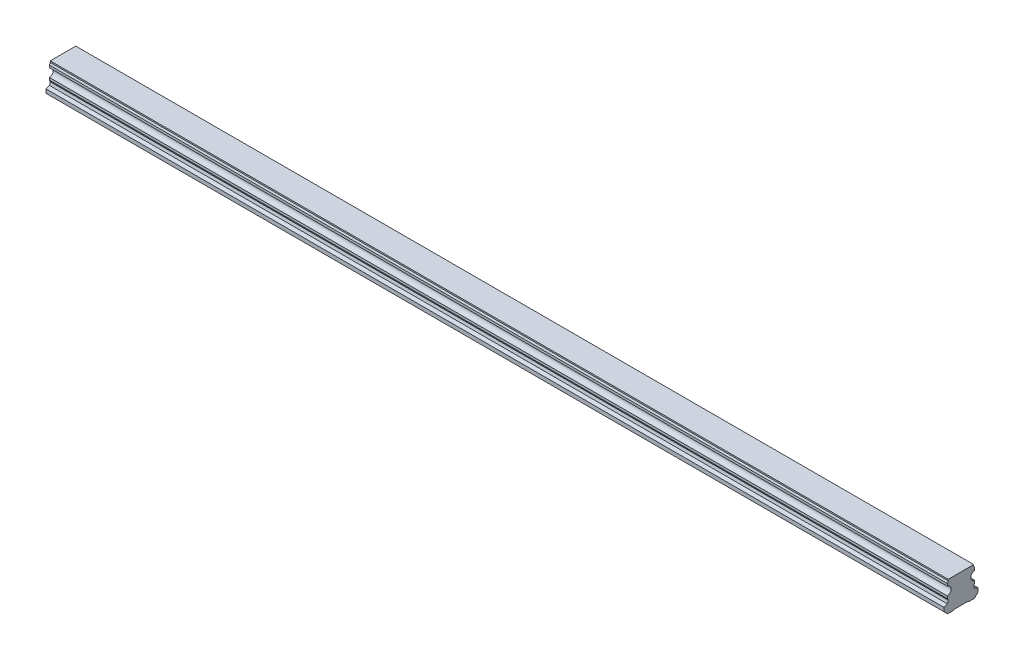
ISO-10303-21;
HEADER;
FILE_DESCRIPTION(('STEP AP214'),'2;1');
FILE_NAME('part.step','',(''),(''),'','','');
FILE_SCHEMA(('AUTOMOTIVE_DESIGN { 1 0 10303 214 1 1 1 1 }'));
ENDSEC;
DATA;
#1=APPLICATION_CONTEXT('core data for automotive mechanical design processes');
#2=APPLICATION_PROTOCOL_DEFINITION('international standard','automotive_design',2000,#1);
#3=PRODUCT_CONTEXT('',#1,'mechanical');
#4=PRODUCT('Part','Part','',(#3));
#5=PRODUCT_RELATED_PRODUCT_CATEGORY('part','',(#4));
#6=PRODUCT_DEFINITION_FORMATION('','',#4);
#7=PRODUCT_DEFINITION_CONTEXT('part definition',#1,'design');
#8=PRODUCT_DEFINITION('design','',#6,#7);
#9=PRODUCT_DEFINITION_SHAPE('','',#8);
#10=(LENGTH_UNIT() NAMED_UNIT(*) SI_UNIT(.MILLI.,.METRE.));
#11=(NAMED_UNIT(*) PLANE_ANGLE_UNIT() SI_UNIT($,.RADIAN.));
#12=(NAMED_UNIT(*) SI_UNIT($,.STERADIAN.) SOLID_ANGLE_UNIT());
#13=UNCERTAINTY_MEASURE_WITH_UNIT(LENGTH_MEASURE(1.E-05),#10,'distance_accuracy_value','');
#14=(GEOMETRIC_REPRESENTATION_CONTEXT(3) GLOBAL_UNCERTAINTY_ASSIGNED_CONTEXT((#13)) GLOBAL_UNIT_ASSIGNED_CONTEXT((#10,
#11,#12)) REPRESENTATION_CONTEXT('',''));
#15=CARTESIAN_POINT('',(0.,0.,0.));
#16=DIRECTION('',(0.,0.,1.));
#17=DIRECTION('',(1.,0.,0.));
#18=AXIS2_PLACEMENT_3D('',#15,#16,#17);
#19=CARTESIAN_POINT('',(630.,0.499999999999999,0.));
#20=DIRECTION('',(0.,-1.,0.));
#21=DIRECTION('',(0.,0.,-1.));
#22=AXIS2_PLACEMENT_3D('',#19,#20,#21);
#23=CONICAL_SURFACE('',#22,3.5,0.785398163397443);
#24=CARTESIAN_POINT('',(630.,1.00000000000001,0.));
#25=DIRECTION('',(0.,1.,0.));
#26=DIRECTION('',(0.,0.,1.));
#27=AXIS2_PLACEMENT_3D('',#24,#25,#26);
#28=CIRCLE('',#27,3.);
#29=CARTESIAN_POINT('',(630.,1.00000000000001,3.));
#30=VERTEX_POINT('',#29);
#31=EDGE_CURVE('E11',#30,#30,#28,.F.);
#32=ORIENTED_EDGE('',*,*,#31,.F.);
#33=EDGE_LOOP('',(#32));
#34=FACE_BOUND('',#33,.T.);
#35=CARTESIAN_POINT('',(630.,0.499999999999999,0.));
#36=DIRECTION('',(0.,1.,0.));
#37=DIRECTION('',(0.,0.,1.));
#38=AXIS2_PLACEMENT_3D('',#35,#36,#37);
#39=CIRCLE('',#38,3.5);
#40=CARTESIAN_POINT('',(630.,0.5,3.5));
#41=VERTEX_POINT('',#40);
#42=EDGE_CURVE('E531',#41,#41,#39,.T.);
#43=ORIENTED_EDGE('',*,*,#42,.F.);
#44=EDGE_LOOP('',(#43));
#45=FACE_BOUND('',#44,.T.);
#46=ADVANCED_FACE('F39',(#34,#45),#23,.F.);
#47=CARTESIAN_POINT('',(630.,12.,0.));
#48=DIRECTION('',(0.,-1.,0.));
#49=DIRECTION('',(0.,0.,-1.));
#50=AXIS2_PLACEMENT_3D('',#47,#48,#49);
#51=CYLINDRICAL_SURFACE('',#50,3.);
#52=ORIENTED_EDGE('',*,*,#31,.T.);
#53=EDGE_LOOP('',(#52));
#54=FACE_BOUND('',#53,.T.);
#55=CARTESIAN_POINT('',(630.,12.,0.));
#56=DIRECTION('',(0.,-1.,0.));
#57=DIRECTION('',(0.,0.,-1.));
#58=AXIS2_PLACEMENT_3D('',#55,#56,#57);
#59=CIRCLE('',#58,3.);
#60=CARTESIAN_POINT('',(630.,12.,-3.));
#61=VERTEX_POINT('',#60);
#62=EDGE_CURVE('E49',#61,#61,#59,.T.);
#63=ORIENTED_EDGE('',*,*,#62,.F.);
#64=EDGE_LOOP('',(#63));
#65=FACE_BOUND('',#64,.T.);
#66=ADVANCED_FACE('F728',(#54,#65),#51,.F.);
#67=CARTESIAN_POINT('',(630.,12.,0.));
#68=DIRECTION('',(0.,-1.,0.));
#69=DIRECTION('',(0.,0.,-1.));
#70=AXIS2_PLACEMENT_3D('',#67,#68,#69);
#71=PLANE('',#70);
#72=CARTESIAN_POINT('',(630.,12.,0.));
#73=DIRECTION('',(0.,-1.,0.));
#74=DIRECTION('',(0.,0.,-1.));
#75=AXIS2_PLACEMENT_3D('',#72,#73,#74);
#76=CIRCLE('',#75,2.5);
#77=CARTESIAN_POINT('',(630.,12.,-2.5));
#78=VERTEX_POINT('',#77);
#79=EDGE_CURVE('E42',#78,#78,#76,.T.);
#80=ORIENTED_EDGE('',*,*,#79,.F.);
#81=EDGE_LOOP('',(#80));
#82=FACE_BOUND('',#81,.T.);
#83=ORIENTED_EDGE('',*,*,#62,.T.);
#84=EDGE_LOOP('',(#83));
#85=FACE_BOUND('',#84,.T.);
#86=ADVANCED_FACE('F733',(#82,#85),#71,.T.);
#87=CARTESIAN_POINT('',(570.,0.499999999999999,0.));
#88=DIRECTION('',(0.,-1.,0.));
#89=DIRECTION('',(0.,0.,-1.));
#90=AXIS2_PLACEMENT_3D('',#87,#88,#89);
#91=CONICAL_SURFACE('',#90,3.5,0.785398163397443);
#92=CARTESIAN_POINT('',(570.,1.00000000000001,0.));
#93=DIRECTION('',(0.,1.,0.));
#94=DIRECTION('',(0.,0.,1.));
#95=AXIS2_PLACEMENT_3D('',#92,#93,#94);
#96=CIRCLE('',#95,3.);
#97=CARTESIAN_POINT('',(570.,1.00000000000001,3.));
#98=VERTEX_POINT('',#97);
#99=EDGE_CURVE('E527',#98,#98,#96,.F.);
#100=ORIENTED_EDGE('',*,*,#99,.F.);
#101=EDGE_LOOP('',(#100));
#102=FACE_BOUND('',#101,.T.);
#103=CARTESIAN_POINT('',(570.,0.499999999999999,0.));
#104=DIRECTION('',(0.,1.,0.));
#105=DIRECTION('',(0.,0.,1.));
#106=AXIS2_PLACEMENT_3D('',#103,#104,#105);
#107=CIRCLE('',#106,3.5);
#108=CARTESIAN_POINT('',(570.,0.5,3.5));
#109=VERTEX_POINT('',#108);
#110=EDGE_CURVE('E519',#109,#109,#107,.T.);
#111=ORIENTED_EDGE('',*,*,#110,.F.);
#112=EDGE_LOOP('',(#111));
#113=FACE_BOUND('',#112,.T.);
#114=ADVANCED_FACE('F904',(#102,#113),#91,.F.);
#115=CARTESIAN_POINT('',(570.,12.,0.));
#116=DIRECTION('',(0.,-1.,0.));
#117=DIRECTION('',(0.,0.,-1.));
#118=AXIS2_PLACEMENT_3D('',#115,#116,#117);
#119=CYLINDRICAL_SURFACE('',#118,3.);
#120=ORIENTED_EDGE('',*,*,#99,.T.);
#121=EDGE_LOOP('',(#120));
#122=FACE_BOUND('',#121,.T.);
#123=CARTESIAN_POINT('',(570.,12.,0.));
#124=DIRECTION('',(0.,-1.,0.));
#125=DIRECTION('',(0.,0.,-1.));
#126=AXIS2_PLACEMENT_3D('',#123,#124,#125);
#127=CIRCLE('',#126,3.);
#128=CARTESIAN_POINT('',(570.,12.,-3.));
#129=VERTEX_POINT('',#128);
#130=EDGE_CURVE('E523',#129,#129,#127,.T.);
#131=ORIENTED_EDGE('',*,*,#130,.F.);
#132=EDGE_LOOP('',(#131));
#133=FACE_BOUND('',#132,.T.);
#134=ADVANCED_FACE('F900',(#122,#133),#119,.F.);
#135=CARTESIAN_POINT('',(570.,12.,0.));
#136=DIRECTION('',(0.,-1.,0.));
#137=DIRECTION('',(0.,0.,-1.));
#138=AXIS2_PLACEMENT_3D('',#135,#136,#137);
#139=PLANE('',#138);
#140=CARTESIAN_POINT('',(570.,12.,0.));
#141=DIRECTION('',(0.,-1.,0.));
#142=DIRECTION('',(0.,0.,-1.));
#143=AXIS2_PLACEMENT_3D('',#140,#141,#142);
#144=CIRCLE('',#143,2.5);
#145=CARTESIAN_POINT('',(570.,12.,-2.5));
#146=VERTEX_POINT('',#145);
#147=EDGE_CURVE('E569',#146,#146,#144,.T.);
#148=ORIENTED_EDGE('',*,*,#147,.F.);
#149=EDGE_LOOP('',(#148));
#150=FACE_BOUND('',#149,.T.);
#151=ORIENTED_EDGE('',*,*,#130,.T.);
#152=EDGE_LOOP('',(#151));
#153=FACE_BOUND('',#152,.T.);
#154=ADVANCED_FACE('F896',(#150,#153),#139,.T.);
#155=CARTESIAN_POINT('',(510.,0.499999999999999,0.));
#156=DIRECTION('',(0.,-1.,0.));
#157=DIRECTION('',(0.,0.,-1.));
#158=AXIS2_PLACEMENT_3D('',#155,#156,#157);
#159=CONICAL_SURFACE('',#158,3.5,0.785398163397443);
#160=CARTESIAN_POINT('',(510.,1.00000000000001,0.));
#161=DIRECTION('',(0.,1.,0.));
#162=DIRECTION('',(0.,0.,1.));
#163=AXIS2_PLACEMENT_3D('',#160,#161,#162);
#164=CIRCLE('',#163,3.);
#165=CARTESIAN_POINT('',(510.,1.00000000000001,3.));
#166=VERTEX_POINT('',#165);
#167=EDGE_CURVE('E515',#166,#166,#164,.F.);
#168=ORIENTED_EDGE('',*,*,#167,.F.);
#169=EDGE_LOOP('',(#168));
#170=FACE_BOUND('',#169,.T.);
#171=CARTESIAN_POINT('',(510.,0.499999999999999,0.));
#172=DIRECTION('',(0.,1.,0.));
#173=DIRECTION('',(0.,0.,1.));
#174=AXIS2_PLACEMENT_3D('',#171,#172,#173);
#175=CIRCLE('',#174,3.5);
#176=CARTESIAN_POINT('',(510.,0.5,3.5));
#177=VERTEX_POINT('',#176);
#178=EDGE_CURVE('E507',#177,#177,#175,.T.);
#179=ORIENTED_EDGE('',*,*,#178,.F.);
#180=EDGE_LOOP('',(#179));
#181=FACE_BOUND('',#180,.T.);
#182=ADVANCED_FACE('F892',(#170,#181),#159,.F.);
#183=CARTESIAN_POINT('',(510.,12.,0.));
#184=DIRECTION('',(0.,-1.,0.));
#185=DIRECTION('',(0.,0.,-1.));
#186=AXIS2_PLACEMENT_3D('',#183,#184,#185);
#187=CYLINDRICAL_SURFACE('',#186,3.);
#188=ORIENTED_EDGE('',*,*,#167,.T.);
#189=EDGE_LOOP('',(#188));
#190=FACE_BOUND('',#189,.T.);
#191=CARTESIAN_POINT('',(510.,12.,0.));
#192=DIRECTION('',(0.,-1.,0.));
#193=DIRECTION('',(0.,0.,-1.));
#194=AXIS2_PLACEMENT_3D('',#191,#192,#193);
#195=CIRCLE('',#194,3.);
#196=CARTESIAN_POINT('',(510.,12.,-3.));
#197=VERTEX_POINT('',#196);
#198=EDGE_CURVE('E511',#197,#197,#195,.T.);
#199=ORIENTED_EDGE('',*,*,#198,.F.);
#200=EDGE_LOOP('',(#199));
#201=FACE_BOUND('',#200,.T.);
#202=ADVANCED_FACE('F888',(#190,#201),#187,.F.);
#203=CARTESIAN_POINT('',(510.,12.,0.));
#204=DIRECTION('',(0.,-1.,0.));
#205=DIRECTION('',(0.,0.,-1.));
#206=AXIS2_PLACEMENT_3D('',#203,#204,#205);
#207=PLANE('',#206);
#208=CARTESIAN_POINT('',(510.,12.,0.));
#209=DIRECTION('',(0.,-1.,0.));
#210=DIRECTION('',(0.,0.,-1.));
#211=AXIS2_PLACEMENT_3D('',#208,#209,#210);
#212=CIRCLE('',#211,2.5);
#213=CARTESIAN_POINT('',(510.,12.,-2.5));
#214=VERTEX_POINT('',#213);
#215=EDGE_CURVE('E566',#214,#214,#212,.T.);
#216=ORIENTED_EDGE('',*,*,#215,.F.);
#217=EDGE_LOOP('',(#216));
#218=FACE_BOUND('',#217,.T.);
#219=ORIENTED_EDGE('',*,*,#198,.T.);
#220=EDGE_LOOP('',(#219));
#221=FACE_BOUND('',#220,.T.);
#222=ADVANCED_FACE('F884',(#218,#221),#207,.T.);
#223=CARTESIAN_POINT('',(450.,0.499999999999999,0.));
#224=DIRECTION('',(0.,-1.,0.));
#225=DIRECTION('',(0.,0.,-1.));
#226=AXIS2_PLACEMENT_3D('',#223,#224,#225);
#227=CONICAL_SURFACE('',#226,3.5,0.785398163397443);
#228=CARTESIAN_POINT('',(450.,1.00000000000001,0.));
#229=DIRECTION('',(0.,1.,0.));
#230=DIRECTION('',(0.,0.,1.));
#231=AXIS2_PLACEMENT_3D('',#228,#229,#230);
#232=CIRCLE('',#231,3.);
#233=CARTESIAN_POINT('',(450.,1.00000000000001,3.));
#234=VERTEX_POINT('',#233);
#235=EDGE_CURVE('E503',#234,#234,#232,.F.);
#236=ORIENTED_EDGE('',*,*,#235,.F.);
#237=EDGE_LOOP('',(#236));
#238=FACE_BOUND('',#237,.T.);
#239=CARTESIAN_POINT('',(450.,0.499999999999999,0.));
#240=DIRECTION('',(0.,1.,0.));
#241=DIRECTION('',(0.,0.,1.));
#242=AXIS2_PLACEMENT_3D('',#239,#240,#241);
#243=CIRCLE('',#242,3.5);
#244=CARTESIAN_POINT('',(450.,0.5,3.5));
#245=VERTEX_POINT('',#244);
#246=EDGE_CURVE('E495',#245,#245,#243,.T.);
#247=ORIENTED_EDGE('',*,*,#246,.F.);
#248=EDGE_LOOP('',(#247));
#249=FACE_BOUND('',#248,.T.);
#250=ADVANCED_FACE('F880',(#238,#249),#227,.F.);
#251=CARTESIAN_POINT('',(450.,12.,0.));
#252=DIRECTION('',(0.,-1.,0.));
#253=DIRECTION('',(0.,0.,-1.));
#254=AXIS2_PLACEMENT_3D('',#251,#252,#253);
#255=CYLINDRICAL_SURFACE('',#254,3.);
#256=ORIENTED_EDGE('',*,*,#235,.T.);
#257=EDGE_LOOP('',(#256));
#258=FACE_BOUND('',#257,.T.);
#259=CARTESIAN_POINT('',(450.,12.,0.));
#260=DIRECTION('',(0.,-1.,0.));
#261=DIRECTION('',(0.,0.,-1.));
#262=AXIS2_PLACEMENT_3D('',#259,#260,#261);
#263=CIRCLE('',#262,3.);
#264=CARTESIAN_POINT('',(450.,12.,-3.));
#265=VERTEX_POINT('',#264);
#266=EDGE_CURVE('E499',#265,#265,#263,.T.);
#267=ORIENTED_EDGE('',*,*,#266,.F.);
#268=EDGE_LOOP('',(#267));
#269=FACE_BOUND('',#268,.T.);
#270=ADVANCED_FACE('F876',(#258,#269),#255,.F.);
#271=CARTESIAN_POINT('',(450.,12.,0.));
#272=DIRECTION('',(0.,-1.,0.));
#273=DIRECTION('',(0.,0.,-1.));
#274=AXIS2_PLACEMENT_3D('',#271,#272,#273);
#275=PLANE('',#274);
#276=CARTESIAN_POINT('',(450.,12.,0.));
#277=DIRECTION('',(0.,-1.,0.));
#278=DIRECTION('',(0.,0.,-1.));
#279=AXIS2_PLACEMENT_3D('',#276,#277,#278);
#280=CIRCLE('',#279,2.5);
#281=CARTESIAN_POINT('',(450.,12.,-2.5));
#282=VERTEX_POINT('',#281);
#283=EDGE_CURVE('E562',#282,#282,#280,.T.);
#284=ORIENTED_EDGE('',*,*,#283,.F.);
#285=EDGE_LOOP('',(#284));
#286=FACE_BOUND('',#285,.T.);
#287=ORIENTED_EDGE('',*,*,#266,.T.);
#288=EDGE_LOOP('',(#287));
#289=FACE_BOUND('',#288,.T.);
#290=ADVANCED_FACE('F872',(#286,#289),#275,.T.);
#291=CARTESIAN_POINT('',(390.,0.499999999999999,0.));
#292=DIRECTION('',(0.,-1.,0.));
#293=DIRECTION('',(0.,0.,-1.));
#294=AXIS2_PLACEMENT_3D('',#291,#292,#293);
#295=CONICAL_SURFACE('',#294,3.5,0.785398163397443);
#296=CARTESIAN_POINT('',(390.,1.00000000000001,0.));
#297=DIRECTION('',(0.,1.,0.));
#298=DIRECTION('',(0.,0.,1.));
#299=AXIS2_PLACEMENT_3D('',#296,#297,#298);
#300=CIRCLE('',#299,3.);
#301=CARTESIAN_POINT('',(390.,1.00000000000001,3.));
#302=VERTEX_POINT('',#301);
#303=EDGE_CURVE('E491',#302,#302,#300,.F.);
#304=ORIENTED_EDGE('',*,*,#303,.F.);
#305=EDGE_LOOP('',(#304));
#306=FACE_BOUND('',#305,.T.);
#307=CARTESIAN_POINT('',(390.,0.499999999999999,0.));
#308=DIRECTION('',(0.,1.,0.));
#309=DIRECTION('',(0.,0.,1.));
#310=AXIS2_PLACEMENT_3D('',#307,#308,#309);
#311=CIRCLE('',#310,3.5);
#312=CARTESIAN_POINT('',(390.,0.5,3.5));
#313=VERTEX_POINT('',#312);
#314=EDGE_CURVE('E483',#313,#313,#311,.T.);
#315=ORIENTED_EDGE('',*,*,#314,.F.);
#316=EDGE_LOOP('',(#315));
#317=FACE_BOUND('',#316,.T.);
#318=ADVANCED_FACE('F868',(#306,#317),#295,.F.);
#319=CARTESIAN_POINT('',(390.,12.,0.));
#320=DIRECTION('',(0.,-1.,0.));
#321=DIRECTION('',(0.,0.,-1.));
#322=AXIS2_PLACEMENT_3D('',#319,#320,#321);
#323=CYLINDRICAL_SURFACE('',#322,3.);
#324=ORIENTED_EDGE('',*,*,#303,.T.);
#325=EDGE_LOOP('',(#324));
#326=FACE_BOUND('',#325,.T.);
#327=CARTESIAN_POINT('',(390.,12.,0.));
#328=DIRECTION('',(0.,-1.,0.));
#329=DIRECTION('',(0.,0.,-1.));
#330=AXIS2_PLACEMENT_3D('',#327,#328,#329);
#331=CIRCLE('',#330,3.);
#332=CARTESIAN_POINT('',(390.,12.,-3.));
#333=VERTEX_POINT('',#332);
#334=EDGE_CURVE('E487',#333,#333,#331,.T.);
#335=ORIENTED_EDGE('',*,*,#334,.F.);
#336=EDGE_LOOP('',(#335));
#337=FACE_BOUND('',#336,.T.);
#338=ADVANCED_FACE('F864',(#326,#337),#323,.F.);
#339=CARTESIAN_POINT('',(390.,12.,0.));
#340=DIRECTION('',(0.,-1.,0.));
#341=DIRECTION('',(0.,0.,-1.));
#342=AXIS2_PLACEMENT_3D('',#339,#340,#341);
#343=PLANE('',#342);
#344=CARTESIAN_POINT('',(390.,12.,0.));
#345=DIRECTION('',(0.,-1.,0.));
#346=DIRECTION('',(0.,0.,-1.));
#347=AXIS2_PLACEMENT_3D('',#344,#345,#346);
#348=CIRCLE('',#347,2.5);
#349=CARTESIAN_POINT('',(390.,12.,-2.5));
#350=VERTEX_POINT('',#349);
#351=EDGE_CURVE('E558',#350,#350,#348,.T.);
#352=ORIENTED_EDGE('',*,*,#351,.F.);
#353=EDGE_LOOP('',(#352));
#354=FACE_BOUND('',#353,.T.);
#355=ORIENTED_EDGE('',*,*,#334,.T.);
#356=EDGE_LOOP('',(#355));
#357=FACE_BOUND('',#356,.T.);
#358=ADVANCED_FACE('F860',(#354,#357),#343,.T.);
#359=CARTESIAN_POINT('',(330.,0.499999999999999,0.));
#360=DIRECTION('',(0.,-1.,0.));
#361=DIRECTION('',(0.,0.,-1.));
#362=AXIS2_PLACEMENT_3D('',#359,#360,#361);
#363=CONICAL_SURFACE('',#362,3.5,0.785398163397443);
#364=CARTESIAN_POINT('',(330.,1.00000000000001,0.));
#365=DIRECTION('',(0.,1.,0.));
#366=DIRECTION('',(0.,0.,1.));
#367=AXIS2_PLACEMENT_3D('',#364,#365,#366);
#368=CIRCLE('',#367,3.);
#369=CARTESIAN_POINT('',(330.,1.00000000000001,3.));
#370=VERTEX_POINT('',#369);
#371=EDGE_CURVE('E479',#370,#370,#368,.F.);
#372=ORIENTED_EDGE('',*,*,#371,.F.);
#373=EDGE_LOOP('',(#372));
#374=FACE_BOUND('',#373,.T.);
#375=CARTESIAN_POINT('',(330.,0.499999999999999,0.));
#376=DIRECTION('',(0.,1.,0.));
#377=DIRECTION('',(0.,0.,1.));
#378=AXIS2_PLACEMENT_3D('',#375,#376,#377);
#379=CIRCLE('',#378,3.5);
#380=CARTESIAN_POINT('',(330.,0.5,3.5));
#381=VERTEX_POINT('',#380);
#382=EDGE_CURVE('E471',#381,#381,#379,.T.);
#383=ORIENTED_EDGE('',*,*,#382,.F.);
#384=EDGE_LOOP('',(#383));
#385=FACE_BOUND('',#384,.T.);
#386=ADVANCED_FACE('F856',(#374,#385),#363,.F.);
#387=CARTESIAN_POINT('',(330.,12.,0.));
#388=DIRECTION('',(0.,-1.,0.));
#389=DIRECTION('',(0.,0.,-1.));
#390=AXIS2_PLACEMENT_3D('',#387,#388,#389);
#391=CYLINDRICAL_SURFACE('',#390,3.);
#392=ORIENTED_EDGE('',*,*,#371,.T.);
#393=EDGE_LOOP('',(#392));
#394=FACE_BOUND('',#393,.T.);
#395=CARTESIAN_POINT('',(330.,12.,0.));
#396=DIRECTION('',(0.,-1.,0.));
#397=DIRECTION('',(0.,0.,-1.));
#398=AXIS2_PLACEMENT_3D('',#395,#396,#397);
#399=CIRCLE('',#398,3.);
#400=CARTESIAN_POINT('',(330.,12.,-3.));
#401=VERTEX_POINT('',#400);
#402=EDGE_CURVE('E475',#401,#401,#399,.T.);
#403=ORIENTED_EDGE('',*,*,#402,.F.);
#404=EDGE_LOOP('',(#403));
#405=FACE_BOUND('',#404,.T.);
#406=ADVANCED_FACE('F852',(#394,#405),#391,.F.);
#407=CARTESIAN_POINT('',(330.,12.,0.));
#408=DIRECTION('',(0.,-1.,0.));
#409=DIRECTION('',(0.,0.,-1.));
#410=AXIS2_PLACEMENT_3D('',#407,#408,#409);
#411=PLANE('',#410);
#412=CARTESIAN_POINT('',(330.,12.,0.));
#413=DIRECTION('',(0.,-1.,0.));
#414=DIRECTION('',(0.,0.,-1.));
#415=AXIS2_PLACEMENT_3D('',#412,#413,#414);
#416=CIRCLE('',#415,2.5);
#417=CARTESIAN_POINT('',(330.,12.,-2.5));
#418=VERTEX_POINT('',#417);
#419=EDGE_CURVE('E554',#418,#418,#416,.T.);
#420=ORIENTED_EDGE('',*,*,#419,.F.);
#421=EDGE_LOOP('',(#420));
#422=FACE_BOUND('',#421,.T.);
#423=ORIENTED_EDGE('',*,*,#402,.T.);
#424=EDGE_LOOP('',(#423));
#425=FACE_BOUND('',#424,.T.);
#426=ADVANCED_FACE('F848',(#422,#425),#411,.T.);
#427=CARTESIAN_POINT('',(270.,0.499999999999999,0.));
#428=DIRECTION('',(0.,-1.,0.));
#429=DIRECTION('',(0.,0.,-1.));
#430=AXIS2_PLACEMENT_3D('',#427,#428,#429);
#431=CONICAL_SURFACE('',#430,3.5,0.785398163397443);
#432=CARTESIAN_POINT('',(270.,1.00000000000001,0.));
#433=DIRECTION('',(0.,1.,0.));
#434=DIRECTION('',(0.,0.,1.));
#435=AXIS2_PLACEMENT_3D('',#432,#433,#434);
#436=CIRCLE('',#435,3.);
#437=CARTESIAN_POINT('',(270.,1.00000000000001,3.));
#438=VERTEX_POINT('',#437);
#439=EDGE_CURVE('E467',#438,#438,#436,.F.);
#440=ORIENTED_EDGE('',*,*,#439,.F.);
#441=EDGE_LOOP('',(#440));
#442=FACE_BOUND('',#441,.T.);
#443=CARTESIAN_POINT('',(270.,0.499999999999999,0.));
#444=DIRECTION('',(0.,1.,0.));
#445=DIRECTION('',(0.,0.,1.));
#446=AXIS2_PLACEMENT_3D('',#443,#444,#445);
#447=CIRCLE('',#446,3.5);
#448=CARTESIAN_POINT('',(270.,0.5,3.5));
#449=VERTEX_POINT('',#448);
#450=EDGE_CURVE('E459',#449,#449,#447,.T.);
#451=ORIENTED_EDGE('',*,*,#450,.F.);
#452=EDGE_LOOP('',(#451));
#453=FACE_BOUND('',#452,.T.);
#454=ADVANCED_FACE('F844',(#442,#453),#431,.F.);
#455=CARTESIAN_POINT('',(270.,12.,0.));
#456=DIRECTION('',(0.,-1.,0.));
#457=DIRECTION('',(0.,0.,-1.));
#458=AXIS2_PLACEMENT_3D('',#455,#456,#457);
#459=CYLINDRICAL_SURFACE('',#458,3.);
#460=ORIENTED_EDGE('',*,*,#439,.T.);
#461=EDGE_LOOP('',(#460));
#462=FACE_BOUND('',#461,.T.);
#463=CARTESIAN_POINT('',(270.,12.,0.));
#464=DIRECTION('',(0.,-1.,0.));
#465=DIRECTION('',(0.,0.,-1.));
#466=AXIS2_PLACEMENT_3D('',#463,#464,#465);
#467=CIRCLE('',#466,3.);
#468=CARTESIAN_POINT('',(270.,12.,-3.));
#469=VERTEX_POINT('',#468);
#470=EDGE_CURVE('E463',#469,#469,#467,.T.);
#471=ORIENTED_EDGE('',*,*,#470,.F.);
#472=EDGE_LOOP('',(#471));
#473=FACE_BOUND('',#472,.T.);
#474=ADVANCED_FACE('F840',(#462,#473),#459,.F.);
#475=CARTESIAN_POINT('',(270.,12.,0.));
#476=DIRECTION('',(0.,-1.,0.));
#477=DIRECTION('',(0.,0.,-1.));
#478=AXIS2_PLACEMENT_3D('',#475,#476,#477);
#479=PLANE('',#478);
#480=CARTESIAN_POINT('',(270.,12.,0.));
#481=DIRECTION('',(0.,-1.,0.));
#482=DIRECTION('',(0.,0.,-1.));
#483=AXIS2_PLACEMENT_3D('',#480,#481,#482);
#484=CIRCLE('',#483,2.5);
#485=CARTESIAN_POINT('',(270.,12.,-2.5));
#486=VERTEX_POINT('',#485);
#487=EDGE_CURVE('E550',#486,#486,#484,.T.);
#488=ORIENTED_EDGE('',*,*,#487,.F.);
#489=EDGE_LOOP('',(#488));
#490=FACE_BOUND('',#489,.T.);
#491=ORIENTED_EDGE('',*,*,#470,.T.);
#492=EDGE_LOOP('',(#491));
#493=FACE_BOUND('',#492,.T.);
#494=ADVANCED_FACE('F836',(#490,#493),#479,.T.);
#495=CARTESIAN_POINT('',(210.,0.499999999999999,0.));
#496=DIRECTION('',(0.,-1.,0.));
#497=DIRECTION('',(0.,0.,-1.));
#498=AXIS2_PLACEMENT_3D('',#495,#496,#497);
#499=CONICAL_SURFACE('',#498,3.5,0.785398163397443);
#500=CARTESIAN_POINT('',(210.,1.00000000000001,0.));
#501=DIRECTION('',(0.,1.,0.));
#502=DIRECTION('',(0.,0.,1.));
#503=AXIS2_PLACEMENT_3D('',#500,#501,#502);
#504=CIRCLE('',#503,3.);
#505=CARTESIAN_POINT('',(210.,1.00000000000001,3.));
#506=VERTEX_POINT('',#505);
#507=EDGE_CURVE('E455',#506,#506,#504,.F.);
#508=ORIENTED_EDGE('',*,*,#507,.F.);
#509=EDGE_LOOP('',(#508));
#510=FACE_BOUND('',#509,.T.);
#511=CARTESIAN_POINT('',(210.,0.499999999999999,0.));
#512=DIRECTION('',(0.,1.,0.));
#513=DIRECTION('',(0.,0.,1.));
#514=AXIS2_PLACEMENT_3D('',#511,#512,#513);
#515=CIRCLE('',#514,3.5);
#516=CARTESIAN_POINT('',(210.,0.5,3.5));
#517=VERTEX_POINT('',#516);
#518=EDGE_CURVE('E447',#517,#517,#515,.T.);
#519=ORIENTED_EDGE('',*,*,#518,.F.);
#520=EDGE_LOOP('',(#519));
#521=FACE_BOUND('',#520,.T.);
#522=ADVANCED_FACE('F832',(#510,#521),#499,.F.);
#523=CARTESIAN_POINT('',(210.,12.,0.));
#524=DIRECTION('',(0.,-1.,0.));
#525=DIRECTION('',(0.,0.,-1.));
#526=AXIS2_PLACEMENT_3D('',#523,#524,#525);
#527=CYLINDRICAL_SURFACE('',#526,3.);
#528=ORIENTED_EDGE('',*,*,#507,.T.);
#529=EDGE_LOOP('',(#528));
#530=FACE_BOUND('',#529,.T.);
#531=CARTESIAN_POINT('',(210.,12.,0.));
#532=DIRECTION('',(0.,-1.,0.));
#533=DIRECTION('',(0.,0.,-1.));
#534=AXIS2_PLACEMENT_3D('',#531,#532,#533);
#535=CIRCLE('',#534,3.);
#536=CARTESIAN_POINT('',(210.,12.,-3.));
#537=VERTEX_POINT('',#536);
#538=EDGE_CURVE('E451',#537,#537,#535,.T.);
#539=ORIENTED_EDGE('',*,*,#538,.F.);
#540=EDGE_LOOP('',(#539));
#541=FACE_BOUND('',#540,.T.);
#542=ADVANCED_FACE('F828',(#530,#541),#527,.F.);
#543=CARTESIAN_POINT('',(210.,12.,0.));
#544=DIRECTION('',(0.,-1.,0.));
#545=DIRECTION('',(0.,0.,-1.));
#546=AXIS2_PLACEMENT_3D('',#543,#544,#545);
#547=PLANE('',#546);
#548=CARTESIAN_POINT('',(210.,12.,0.));
#549=DIRECTION('',(0.,-1.,0.));
#550=DIRECTION('',(0.,0.,-1.));
#551=AXIS2_PLACEMENT_3D('',#548,#549,#550);
#552=CIRCLE('',#551,2.5);
#553=CARTESIAN_POINT('',(210.,12.,-2.5));
#554=VERTEX_POINT('',#553);
#555=EDGE_CURVE('E546',#554,#554,#552,.T.);
#556=ORIENTED_EDGE('',*,*,#555,.F.);
#557=EDGE_LOOP('',(#556));
#558=FACE_BOUND('',#557,.T.);
#559=ORIENTED_EDGE('',*,*,#538,.T.);
#560=EDGE_LOOP('',(#559));
#561=FACE_BOUND('',#560,.T.);
#562=ADVANCED_FACE('F824',(#558,#561),#547,.T.);
#563=CARTESIAN_POINT('',(150.,0.499999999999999,0.));
#564=DIRECTION('',(0.,-1.,0.));
#565=DIRECTION('',(0.,0.,-1.));
#566=AXIS2_PLACEMENT_3D('',#563,#564,#565);
#567=CONICAL_SURFACE('',#566,3.5,0.785398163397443);
#568=CARTESIAN_POINT('',(150.,1.00000000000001,0.));
#569=DIRECTION('',(0.,1.,0.));
#570=DIRECTION('',(0.,0.,1.));
#571=AXIS2_PLACEMENT_3D('',#568,#569,#570);
#572=CIRCLE('',#571,3.);
#573=CARTESIAN_POINT('',(150.,1.00000000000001,3.));
#574=VERTEX_POINT('',#573);
#575=EDGE_CURVE('E443',#574,#574,#572,.F.);
#576=ORIENTED_EDGE('',*,*,#575,.F.);
#577=EDGE_LOOP('',(#576));
#578=FACE_BOUND('',#577,.T.);
#579=CARTESIAN_POINT('',(150.,0.499999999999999,0.));
#580=DIRECTION('',(0.,1.,0.));
#581=DIRECTION('',(0.,0.,1.));
#582=AXIS2_PLACEMENT_3D('',#579,#580,#581);
#583=CIRCLE('',#582,3.5);
#584=CARTESIAN_POINT('',(150.,0.5,3.5));
#585=VERTEX_POINT('',#584);
#586=EDGE_CURVE('E435',#585,#585,#583,.T.);
#587=ORIENTED_EDGE('',*,*,#586,.F.);
#588=EDGE_LOOP('',(#587));
#589=FACE_BOUND('',#588,.T.);
#590=ADVANCED_FACE('F820',(#578,#589),#567,.F.);
#591=CARTESIAN_POINT('',(150.,12.,0.));
#592=DIRECTION('',(0.,-1.,0.));
#593=DIRECTION('',(0.,0.,-1.));
#594=AXIS2_PLACEMENT_3D('',#591,#592,#593);
#595=CYLINDRICAL_SURFACE('',#594,3.);
#596=ORIENTED_EDGE('',*,*,#575,.T.);
#597=EDGE_LOOP('',(#596));
#598=FACE_BOUND('',#597,.T.);
#599=CARTESIAN_POINT('',(150.,12.,0.));
#600=DIRECTION('',(0.,-1.,0.));
#601=DIRECTION('',(0.,0.,-1.));
#602=AXIS2_PLACEMENT_3D('',#599,#600,#601);
#603=CIRCLE('',#602,3.);
#604=CARTESIAN_POINT('',(150.,12.,-3.));
#605=VERTEX_POINT('',#604);
#606=EDGE_CURVE('E439',#605,#605,#603,.T.);
#607=ORIENTED_EDGE('',*,*,#606,.F.);
#608=EDGE_LOOP('',(#607));
#609=FACE_BOUND('',#608,.T.);
#610=ADVANCED_FACE('F816',(#598,#609),#595,.F.);
#611=CARTESIAN_POINT('',(150.,12.,0.));
#612=DIRECTION('',(0.,-1.,0.));
#613=DIRECTION('',(0.,0.,-1.));
#614=AXIS2_PLACEMENT_3D('',#611,#612,#613);
#615=PLANE('',#614);
#616=CARTESIAN_POINT('',(150.,12.,0.));
#617=DIRECTION('',(0.,-1.,0.));
#618=DIRECTION('',(0.,0.,-1.));
#619=AXIS2_PLACEMENT_3D('',#616,#617,#618);
#620=CIRCLE('',#619,2.5);
#621=CARTESIAN_POINT('',(150.,12.,-2.5));
#622=VERTEX_POINT('',#621);
#623=EDGE_CURVE('E541',#622,#622,#620,.T.);
#624=ORIENTED_EDGE('',*,*,#623,.F.);
#625=EDGE_LOOP('',(#624));
#626=FACE_BOUND('',#625,.T.);
#627=ORIENTED_EDGE('',*,*,#606,.T.);
#628=EDGE_LOOP('',(#627));
#629=FACE_BOUND('',#628,.T.);
#630=ADVANCED_FACE('F806',(#626,#629),#615,.T.);
#631=CARTESIAN_POINT('',(660.,21.8,-9.375));
#632=DIRECTION('',(0.,0.,1.));
#633=DIRECTION('',(0.,-1.,0.));
#634=AXIS2_PLACEMENT_3D('',#631,#632,#633);
#635=PLANE('',#634);
#636=DIRECTION('',(0.,1.,0.));
#637=VECTOR('',#636,1.);
#638=CARTESIAN_POINT('',(0.,21.8,-9.375));
#639=LINE('',#638,#637);
#640=CARTESIAN_POINT('',(0.,20.756,-9.375));
#641=VERTEX_POINT('',#640);
#642=CARTESIAN_POINT('',(0.,21.8,-9.375));
#643=VERTEX_POINT('',#642);
#644=EDGE_CURVE('E256',#641,#643,#639,.T.);
#645=ORIENTED_EDGE('',*,*,#644,.T.);
#646=DIRECTION('',(-1.,0.,0.));
#647=VECTOR('',#646,1.);
#648=CARTESIAN_POINT('',(660.,21.8,-9.375));
#649=LINE('',#648,#647);
#650=CARTESIAN_POINT('',(660.,21.8,-9.375));
#651=VERTEX_POINT('',#650);
#652=EDGE_CURVE('E424',#651,#643,#649,.T.);
#653=ORIENTED_EDGE('',*,*,#652,.F.);
#654=DIRECTION('',(0.,1.,0.));
#655=VECTOR('',#654,1.);
#656=CARTESIAN_POINT('',(660.,21.8,-9.375));
#657=LINE('',#656,#655);
#658=CARTESIAN_POINT('',(660.,20.756,-9.375));
#659=VERTEX_POINT('',#658);
#660=EDGE_CURVE('E333',#659,#651,#657,.T.);
#661=ORIENTED_EDGE('',*,*,#660,.F.);
#662=DIRECTION('',(-1.,0.,0.));
#663=VECTOR('',#662,1.);
#664=CARTESIAN_POINT('',(660.,20.756,-9.375));
#665=LINE('',#664,#663);
#666=EDGE_CURVE('E252',#659,#641,#665,.T.);
#667=ORIENTED_EDGE('',*,*,#666,.T.);
#668=EDGE_LOOP('',(#645,#653,#661,#667));
#669=FACE_BOUND('',#668,.T.);
#670=ADVANCED_FACE('F803',(#669),#635,.F.);
#671=CARTESIAN_POINT('',(660.,21.8,-9.375));
#672=DIRECTION('',(0.,-1.,0.));
#673=DIRECTION('',(0.,0.,-1.));
#674=AXIS2_PLACEMENT_3D('',#671,#672,#673);
#675=PLANE('',#674);
#676=DIRECTION('',(0.,0.,1.));
#677=VECTOR('',#676,1.);
#678=CARTESIAN_POINT('',(0.,21.8,-9.375));
#679=LINE('',#678,#677);
#680=CARTESIAN_POINT('',(0.,21.8,9.375));
#681=VERTEX_POINT('',#680);
#682=EDGE_CURVE('E260',#643,#681,#679,.T.);
#683=ORIENTED_EDGE('',*,*,#682,.T.);
#684=DIRECTION('',(-1.,0.,0.));
#685=VECTOR('',#684,1.);
#686=CARTESIAN_POINT('',(660.,21.8,9.375));
#687=LINE('',#686,#685);
#688=CARTESIAN_POINT('',(660.,21.8,9.375));
#689=VERTEX_POINT('',#688);
#690=EDGE_CURVE('E420',#689,#681,#687,.T.);
#691=ORIENTED_EDGE('',*,*,#690,.F.);
#692=DIRECTION('',(0.,0.,1.));
#693=VECTOR('',#692,1.);
#694=CARTESIAN_POINT('',(660.,21.8,-9.375));
#695=LINE('',#694,#693);
#696=EDGE_CURVE('E157',#651,#689,#695,.T.);
#697=ORIENTED_EDGE('',*,*,#696,.F.);
#698=ORIENTED_EDGE('',*,*,#652,.T.);
#699=EDGE_LOOP('',(#683,#691,#697,#698));
#700=FACE_BOUND('',#699,.T.);
#701=ADVANCED_FACE('F799',(#700),#675,.F.);
#702=CARTESIAN_POINT('',(660.,21.8,9.375));
#703=DIRECTION('',(0.,0.,-1.));
#704=DIRECTION('',(0.,1.,0.));
#705=AXIS2_PLACEMENT_3D('',#702,#703,#704);
#706=PLANE('',#705);
#707=DIRECTION('',(0.,-1.,0.));
#708=VECTOR('',#707,1.);
#709=CARTESIAN_POINT('',(0.,21.8,9.375));
#710=LINE('',#709,#708);
#711=CARTESIAN_POINT('',(0.,20.756,9.37499999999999));
#712=VERTEX_POINT('',#711);
#713=EDGE_CURVE('E264',#681,#712,#710,.T.);
#714=ORIENTED_EDGE('',*,*,#713,.T.);
#715=DIRECTION('',(-1.,0.,0.));
#716=VECTOR('',#715,1.);
#717=CARTESIAN_POINT('',(660.,20.756,9.37499999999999));
#718=LINE('',#717,#716);
#719=CARTESIAN_POINT('',(660.,20.756,9.37499999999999));
#720=VERTEX_POINT('',#719);
#721=EDGE_CURVE('E416',#720,#712,#718,.T.);
#722=ORIENTED_EDGE('',*,*,#721,.F.);
#723=DIRECTION('',(0.,-1.,0.));
#724=VECTOR('',#723,1.);
#725=CARTESIAN_POINT('',(660.,21.8,9.375));
#726=LINE('',#725,#724);
#727=EDGE_CURVE('E611',#689,#720,#726,.T.);
#728=ORIENTED_EDGE('',*,*,#727,.F.);
#729=ORIENTED_EDGE('',*,*,#690,.T.);
#730=EDGE_LOOP('',(#714,#722,#728,#729));
#731=FACE_BOUND('',#730,.T.);
#732=ADVANCED_FACE('F795',(#731),#706,.F.);
#733=CARTESIAN_POINT('',(660.,20.756,9.37499999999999));
#734=DIRECTION('',(0.,-0.422618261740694,-0.906307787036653));
#735=DIRECTION('',(0.,0.906307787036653,-0.422618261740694));
#736=AXIS2_PLACEMENT_3D('',#733,#734,#735);
#737=PLANE('',#736);
#738=DIRECTION('',(0.,-0.906307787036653,0.422618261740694));
#739=VECTOR('',#738,1.);
#740=CARTESIAN_POINT('',(0.,20.756,9.37499999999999));
#741=LINE('',#740,#739);
#742=CARTESIAN_POINT('',(0.,19.4156831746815,10.));
#743=VERTEX_POINT('',#742);
#744=EDGE_CURVE('E267',#712,#743,#741,.T.);
#745=ORIENTED_EDGE('',*,*,#744,.T.);
#746=DIRECTION('',(-1.,0.,0.));
#747=VECTOR('',#746,1.);
#748=CARTESIAN_POINT('',(660.,19.4156831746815,10.));
#749=LINE('',#748,#747);
#750=CARTESIAN_POINT('',(660.,19.4156831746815,10.));
#751=VERTEX_POINT('',#750);
#752=EDGE_CURVE('E412',#751,#743,#749,.T.);
#753=ORIENTED_EDGE('',*,*,#752,.F.);
#754=DIRECTION('',(0.,-0.906307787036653,0.422618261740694));
#755=VECTOR('',#754,1.);
#756=CARTESIAN_POINT('',(660.,20.756,9.37499999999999));
#757=LINE('',#756,#755);
#758=EDGE_CURVE('E614',#720,#751,#757,.T.);
#759=ORIENTED_EDGE('',*,*,#758,.F.);
#760=ORIENTED_EDGE('',*,*,#721,.T.);
#761=EDGE_LOOP('',(#745,#753,#759,#760));
#762=FACE_BOUND('',#761,.T.);
#763=ADVANCED_FACE('F791',(#762),#737,.F.);
#764=CARTESIAN_POINT('',(660.,19.4156831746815,10.));
#765=DIRECTION('',(0.,0.,-1.));
#766=DIRECTION('',(-1.,0.,0.));
#767=AXIS2_PLACEMENT_3D('',#764,#765,#766);
#768=PLANE('',#767);
#769=DIRECTION('',(0.,-1.,0.));
#770=VECTOR('',#769,1.);
#771=CARTESIAN_POINT('',(0.,19.4156831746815,10.));
#772=LINE('',#771,#770);
#773=CARTESIAN_POINT('',(0.,17.6854497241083,10.));
#774=VERTEX_POINT('',#773);
#775=EDGE_CURVE('E270',#743,#774,#772,.T.);
#776=ORIENTED_EDGE('',*,*,#775,.T.);
#777=DIRECTION('',(-1.,0.,0.));
#778=VECTOR('',#777,1.);
#779=CARTESIAN_POINT('',(660.,17.6854497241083,10.));
#780=LINE('',#779,#778);
#781=CARTESIAN_POINT('',(660.,17.6854497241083,10.));
#782=VERTEX_POINT('',#781);
#783=EDGE_CURVE('E408',#782,#774,#780,.T.);
#784=ORIENTED_EDGE('',*,*,#783,.F.);
#785=DIRECTION('',(0.,-1.,0.));
#786=VECTOR('',#785,1.);
#787=CARTESIAN_POINT('',(660.,19.4156831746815,10.));
#788=LINE('',#787,#786);
#789=EDGE_CURVE('E617',#751,#782,#788,.T.);
#790=ORIENTED_EDGE('',*,*,#789,.F.);
#791=ORIENTED_EDGE('',*,*,#752,.T.);
#792=EDGE_LOOP('',(#776,#784,#790,#791));
#793=FACE_BOUND('',#792,.T.);
#794=ADVANCED_FACE('F787',(#793),#768,.F.);
#795=CARTESIAN_POINT('',(660.,14.6,10.3));
#796=DIRECTION('',(-1.,0.,0.));
#797=DIRECTION('',(0.,0.,1.));
#798=AXIS2_PLACEMENT_3D('',#795,#796,#797);
#799=CYLINDRICAL_SURFACE('',#798,3.1);
#800=CARTESIAN_POINT('',(0.,14.6,10.3));
#801=DIRECTION('',(-1.,0.,0.));
#802=DIRECTION('',(0.,0.,-1.));
#803=AXIS2_PLACEMENT_3D('',#800,#801,#802);
#804=CIRCLE('',#803,3.1);
#805=CARTESIAN_POINT('',(0.,11.5145502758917,10.));
#806=VERTEX_POINT('',#805);
#807=EDGE_CURVE('E273',#774,#806,#804,.T.);
#808=ORIENTED_EDGE('',*,*,#807,.T.);
#809=DIRECTION('',(-1.,0.,0.));
#810=VECTOR('',#809,1.);
#811=CARTESIAN_POINT('',(660.,11.5145502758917,10.));
#812=LINE('',#811,#810);
#813=CARTESIAN_POINT('',(660.,11.5145502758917,10.));
#814=VERTEX_POINT('',#813);
#815=EDGE_CURVE('E404',#814,#806,#812,.T.);
#816=ORIENTED_EDGE('',*,*,#815,.F.);
#817=CARTESIAN_POINT('',(660.,14.6,10.3));
#818=DIRECTION('',(-1.,0.,0.));
#819=DIRECTION('',(0.,0.,-1.));
#820=AXIS2_PLACEMENT_3D('',#817,#818,#819);
#821=CIRCLE('',#820,3.1);
#822=EDGE_CURVE('E620',#782,#814,#821,.T.);
#823=ORIENTED_EDGE('',*,*,#822,.F.);
#824=ORIENTED_EDGE('',*,*,#783,.T.);
#825=EDGE_LOOP('',(#808,#816,#823,#824));
#826=FACE_BOUND('',#825,.T.);
#827=ADVANCED_FACE('F783',(#826),#799,.F.);
#828=CARTESIAN_POINT('',(660.,9.78431682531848,10.));
#829=DIRECTION('',(0.,0.,-1.));
#830=DIRECTION('',(0.,1.,0.));
#831=AXIS2_PLACEMENT_3D('',#828,#829,#830);
#832=PLANE('',#831);
#833=DIRECTION('',(0.,-1.,0.));
#834=VECTOR('',#833,1.);
#835=CARTESIAN_POINT('',(0.,9.78431682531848,10.));
#836=LINE('',#835,#834);
#837=CARTESIAN_POINT('',(0.,9.78431682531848,10.));
#838=VERTEX_POINT('',#837);
#839=EDGE_CURVE('E276',#806,#838,#836,.T.);
#840=ORIENTED_EDGE('',*,*,#839,.T.);
#841=DIRECTION('',(-1.,0.,0.));
#842=VECTOR('',#841,1.);
#843=CARTESIAN_POINT('',(660.,9.78431682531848,10.));
#844=LINE('',#843,#842);
#845=CARTESIAN_POINT('',(660.,9.78431682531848,10.));
#846=VERTEX_POINT('',#845);
#847=EDGE_CURVE('E400',#846,#838,#844,.T.);
#848=ORIENTED_EDGE('',*,*,#847,.F.);
#849=DIRECTION('',(0.,-1.,0.));
#850=VECTOR('',#849,1.);
#851=CARTESIAN_POINT('',(660.,9.78431682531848,10.));
#852=LINE('',#851,#850);
#853=EDGE_CURVE('E623',#814,#846,#852,.T.);
#854=ORIENTED_EDGE('',*,*,#853,.F.);
#855=ORIENTED_EDGE('',*,*,#815,.T.);
#856=EDGE_LOOP('',(#840,#848,#854,#855));
#857=FACE_BOUND('',#856,.T.);
#858=ADVANCED_FACE('F779',(#857),#832,.F.);
#859=CARTESIAN_POINT('',(660.,8.44400000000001,9.375));
#860=DIRECTION('',(0.,0.4226182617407,-0.90630778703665));
#861=DIRECTION('',(0.,0.90630778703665,0.4226182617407));
#862=AXIS2_PLACEMENT_3D('',#859,#860,#861);
#863=PLANE('',#862);
#864=DIRECTION('',(0.,-0.90630778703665,-0.4226182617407));
#865=VECTOR('',#864,1.);
#866=CARTESIAN_POINT('',(0.,8.44400000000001,9.375));
#867=LINE('',#866,#865);
#868=CARTESIAN_POINT('',(0.,8.44400000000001,9.375));
#869=VERTEX_POINT('',#868);
#870=EDGE_CURVE('E279',#838,#869,#867,.T.);
#871=ORIENTED_EDGE('',*,*,#870,.T.);
#872=DIRECTION('',(-1.,0.,0.));
#873=VECTOR('',#872,1.);
#874=CARTESIAN_POINT('',(660.,8.44400000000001,9.375));
#875=LINE('',#874,#873);
#876=CARTESIAN_POINT('',(660.,8.44400000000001,9.375));
#877=VERTEX_POINT('',#876);
#878=EDGE_CURVE('E396',#877,#869,#875,.T.);
#879=ORIENTED_EDGE('',*,*,#878,.F.);
#880=DIRECTION('',(0.,-0.90630778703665,-0.4226182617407));
#881=VECTOR('',#880,1.);
#882=CARTESIAN_POINT('',(660.,8.44400000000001,9.375));
#883=LINE('',#882,#881);
#884=EDGE_CURVE('E626',#846,#877,#883,.T.);
#885=ORIENTED_EDGE('',*,*,#884,.F.);
#886=ORIENTED_EDGE('',*,*,#847,.T.);
#887=EDGE_LOOP('',(#871,#879,#885,#886));
#888=FACE_BOUND('',#887,.T.);
#889=ADVANCED_FACE('F775',(#888),#863,.F.);
#890=CARTESIAN_POINT('',(660.,6.4,9.92268814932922));
#891=DIRECTION('',(0.,-0.258819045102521,-0.965925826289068));
#892=DIRECTION('',(0.,0.965925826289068,-0.258819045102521));
#893=AXIS2_PLACEMENT_3D('',#890,#891,#892);
#894=PLANE('',#893);
#895=DIRECTION('',(0.,-0.965925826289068,0.258819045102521));
#896=VECTOR('',#895,1.);
#897=CARTESIAN_POINT('',(0.,6.4,9.92268814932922));
#898=LINE('',#897,#896);
#899=CARTESIAN_POINT('',(0.,6.4,9.92268814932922));
#900=VERTEX_POINT('',#899);
#901=EDGE_CURVE('E282',#869,#900,#898,.T.);
#902=ORIENTED_EDGE('',*,*,#901,.T.);
#903=DIRECTION('',(-1.,0.,0.));
#904=VECTOR('',#903,1.);
#905=CARTESIAN_POINT('',(660.,6.4,9.92268814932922));
#906=LINE('',#905,#904);
#907=CARTESIAN_POINT('',(660.,6.4,9.92268814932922));
#908=VERTEX_POINT('',#907);
#909=EDGE_CURVE('E392',#908,#900,#906,.T.);
#910=ORIENTED_EDGE('',*,*,#909,.F.);
#911=DIRECTION('',(0.,-0.965925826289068,0.258819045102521));
#912=VECTOR('',#911,1.);
#913=CARTESIAN_POINT('',(660.,6.4,9.92268814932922));
#914=LINE('',#913,#912);
#915=EDGE_CURVE('E629',#877,#908,#914,.T.);
#916=ORIENTED_EDGE('',*,*,#915,.F.);
#917=ORIENTED_EDGE('',*,*,#878,.T.);
#918=EDGE_LOOP('',(#902,#910,#916,#917));
#919=FACE_BOUND('',#918,.T.);
#920=ADVANCED_FACE('F771',(#919),#894,.F.);
#921=CARTESIAN_POINT('',(660.,5.48933857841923,12.5));
#922=DIRECTION('',(0.,-0.942872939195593,-0.333152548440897));
#923=DIRECTION('',(0.,0.333152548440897,-0.942872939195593));
#924=AXIS2_PLACEMENT_3D('',#921,#922,#923);
#925=PLANE('',#924);
#926=DIRECTION('',(0.,-0.333152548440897,0.942872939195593));
#927=VECTOR('',#926,1.);
#928=CARTESIAN_POINT('',(0.,5.48933857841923,12.5));
#929=LINE('',#928,#927);
#930=CARTESIAN_POINT('',(0.,5.48933857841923,12.5));
#931=VERTEX_POINT('',#930);
#932=EDGE_CURVE('E285',#900,#931,#929,.T.);
#933=ORIENTED_EDGE('',*,*,#932,.T.);
#934=DIRECTION('',(-1.,0.,0.));
#935=VECTOR('',#934,1.);
#936=CARTESIAN_POINT('',(660.,5.48933857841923,12.5));
#937=LINE('',#936,#935);
#938=CARTESIAN_POINT('',(660.,5.48933857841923,12.5));
#939=VERTEX_POINT('',#938);
#940=EDGE_CURVE('E388',#939,#931,#937,.T.);
#941=ORIENTED_EDGE('',*,*,#940,.F.);
#942=DIRECTION('',(0.,-0.333152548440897,0.942872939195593));
#943=VECTOR('',#942,1.);
#944=CARTESIAN_POINT('',(660.,5.48933857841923,12.5));
#945=LINE('',#944,#943);
#946=EDGE_CURVE('E632',#908,#939,#945,.T.);
#947=ORIENTED_EDGE('',*,*,#946,.F.);
#948=ORIENTED_EDGE('',*,*,#909,.T.);
#949=EDGE_LOOP('',(#933,#941,#947,#948));
#950=FACE_BOUND('',#949,.T.);
#951=ADVANCED_FACE('F767',(#950),#925,.F.);
#952=CARTESIAN_POINT('',(660.,2.65,12.5));
#953=DIRECTION('',(0.,0.,-1.));
#954=DIRECTION('',(0.,1.,0.));
#955=AXIS2_PLACEMENT_3D('',#952,#953,#954);
#956=PLANE('',#955);
#957=DIRECTION('',(0.,-1.,0.));
#958=VECTOR('',#957,1.);
#959=CARTESIAN_POINT('',(0.,2.65,12.5));
#960=LINE('',#959,#958);
#961=CARTESIAN_POINT('',(0.,2.65,12.5));
#962=VERTEX_POINT('',#961);
#963=EDGE_CURVE('E288',#931,#962,#960,.T.);
#964=ORIENTED_EDGE('',*,*,#963,.T.);
#965=DIRECTION('',(-1.,0.,0.));
#966=VECTOR('',#965,1.);
#967=CARTESIAN_POINT('',(660.,2.65,12.5));
#968=LINE('',#967,#966);
#969=CARTESIAN_POINT('',(660.,2.65,12.5));
#970=VERTEX_POINT('',#969);
#971=EDGE_CURVE('E384',#970,#962,#968,.T.);
#972=ORIENTED_EDGE('',*,*,#971,.F.);
#973=DIRECTION('',(0.,-1.,0.));
#974=VECTOR('',#973,1.);
#975=CARTESIAN_POINT('',(660.,2.65,12.5));
#976=LINE('',#975,#974);
#977=EDGE_CURVE('E635',#939,#970,#976,.T.);
#978=ORIENTED_EDGE('',*,*,#977,.F.);
#979=ORIENTED_EDGE('',*,*,#940,.T.);
#980=EDGE_LOOP('',(#964,#972,#978,#979));
#981=FACE_BOUND('',#980,.T.);
#982=ADVANCED_FACE('F763',(#981),#956,.F.);
#983=CARTESIAN_POINT('',(660.,0.,9.85));
#984=DIRECTION('',(0.,0.707106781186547,-0.707106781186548));
#985=DIRECTION('',(0.,0.707106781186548,0.707106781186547));
#986=AXIS2_PLACEMENT_3D('',#983,#984,#985);
#987=PLANE('',#986);
#988=DIRECTION('',(0.,-0.707106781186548,-0.707106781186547));
#989=VECTOR('',#988,1.);
#990=CARTESIAN_POINT('',(0.,0.,9.85));
#991=LINE('',#990,#989);
#992=CARTESIAN_POINT('',(0.,0.,9.85));
#993=VERTEX_POINT('',#992);
#994=EDGE_CURVE('E291',#962,#993,#991,.T.);
#995=ORIENTED_EDGE('',*,*,#994,.T.);
#996=DIRECTION('',(-1.,0.,0.));
#997=VECTOR('',#996,1.);
#998=CARTESIAN_POINT('',(660.,0.,9.85));
#999=LINE('',#998,#997);
#1000=CARTESIAN_POINT('',(660.,0.,9.85));
#1001=VERTEX_POINT('',#1000);
#1002=EDGE_CURVE('E380',#1001,#993,#999,.T.);
#1003=ORIENTED_EDGE('',*,*,#1002,.F.);
#1004=DIRECTION('',(0.,-0.707106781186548,-0.707106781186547));
#1005=VECTOR('',#1004,1.);
#1006=CARTESIAN_POINT('',(660.,0.,9.85));
#1007=LINE('',#1006,#1005);
#1008=EDGE_CURVE('E638',#970,#1001,#1007,.T.);
#1009=ORIENTED_EDGE('',*,*,#1008,.F.);
#1010=ORIENTED_EDGE('',*,*,#971,.T.);
#1011=EDGE_LOOP('',(#995,#1003,#1009,#1010));
#1012=FACE_BOUND('',#1011,.T.);
#1013=ADVANCED_FACE('F759',(#1012),#987,.F.);
#1014=CARTESIAN_POINT('',(660.,0.,5.5));
#1015=DIRECTION('',(0.,1.,0.));
#1016=DIRECTION('',(0.,0.,1.));
#1017=AXIS2_PLACEMENT_3D('',#1014,#1015,#1016);
#1018=PLANE('',#1017);
#1019=DIRECTION('',(0.,0.,-1.));
#1020=VECTOR('',#1019,1.);
#1021=CARTESIAN_POINT('',(0.,0.,5.5));
#1022=LINE('',#1021,#1020);
#1023=CARTESIAN_POINT('',(0.,0.,5.5));
#1024=VERTEX_POINT('',#1023);
#1025=EDGE_CURVE('E294',#993,#1024,#1022,.T.);
#1026=ORIENTED_EDGE('',*,*,#1025,.T.);
#1027=DIRECTION('',(-1.,0.,0.));
#1028=VECTOR('',#1027,1.);
#1029=CARTESIAN_POINT('',(660.,0.,5.5));
#1030=LINE('',#1029,#1028);
#1031=CARTESIAN_POINT('',(660.,0.,5.5));
#1032=VERTEX_POINT('',#1031);
#1033=EDGE_CURVE('E376',#1032,#1024,#1030,.T.);
#1034=ORIENTED_EDGE('',*,*,#1033,.F.);
#1035=DIRECTION('',(0.,0.,-1.));
#1036=VECTOR('',#1035,1.);
#1037=CARTESIAN_POINT('',(660.,0.,5.5));
#1038=LINE('',#1037,#1036);
#1039=EDGE_CURVE('E641',#1001,#1032,#1038,.T.);
#1040=ORIENTED_EDGE('',*,*,#1039,.F.);
#1041=ORIENTED_EDGE('',*,*,#1002,.T.);
#1042=EDGE_LOOP('',(#1026,#1034,#1040,#1041));
#1043=FACE_BOUND('',#1042,.T.);
#1044=ADVANCED_FACE('F751',(#1043),#1018,.F.);
#1045=CARTESIAN_POINT('',(660.,0.5,5.));
#1046=DIRECTION('',(0.,0.707106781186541,0.707106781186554));
#1047=DIRECTION('',(0.,-0.707106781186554,0.707106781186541));
#1048=AXIS2_PLACEMENT_3D('',#1045,#1046,#1047);
#1049=PLANE('',#1048);
#1050=DIRECTION('',(0.,0.707106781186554,-0.707106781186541));
#1051=VECTOR('',#1050,1.);
#1052=CARTESIAN_POINT('',(0.,0.5,5.));
#1053=LINE('',#1052,#1051);
#1054=CARTESIAN_POINT('',(0.,0.5,5.));
#1055=VERTEX_POINT('',#1054);
#1056=EDGE_CURVE('E297',#1024,#1055,#1053,.T.);
#1057=ORIENTED_EDGE('',*,*,#1056,.T.);
#1058=DIRECTION('',(-1.,0.,0.));
#1059=VECTOR('',#1058,1.);
#1060=CARTESIAN_POINT('',(660.,0.5,5.));
#1061=LINE('',#1060,#1059);
#1062=CARTESIAN_POINT('',(660.,0.5,5.));
#1063=VERTEX_POINT('',#1062);
#1064=EDGE_CURVE('E372',#1063,#1055,#1061,.T.);
#1065=ORIENTED_EDGE('',*,*,#1064,.F.);
#1066=DIRECTION('',(0.,0.707106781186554,-0.707106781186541));
#1067=VECTOR('',#1066,1.);
#1068=CARTESIAN_POINT('',(660.,0.5,5.));
#1069=LINE('',#1068,#1067);
#1070=EDGE_CURVE('E644',#1032,#1063,#1069,.T.);
#1071=ORIENTED_EDGE('',*,*,#1070,.F.);
#1072=ORIENTED_EDGE('',*,*,#1033,.T.);
#1073=EDGE_LOOP('',(#1057,#1065,#1071,#1072));
#1074=FACE_BOUND('',#1073,.T.);
#1075=ADVANCED_FACE('F742',(#1074),#1049,.F.);
#1076=CARTESIAN_POINT('',(660.,0.499999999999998,-5.));
#1077=DIRECTION('',(0.,1.,0.));
#1078=DIRECTION('',(0.,0.,1.));
#1079=AXIS2_PLACEMENT_3D('',#1076,#1077,#1078);
#1080=PLANE('',#1079);
#1081=CARTESIAN_POINT('',(90.,0.499999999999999,0.));
#1082=DIRECTION('',(0.,1.,0.));
#1083=DIRECTION('',(0.,0.,1.));
#1084=AXIS2_PLACEMENT_3D('',#1081,#1082,#1083);
#1085=CIRCLE('',#1084,3.5);
#1086=CARTESIAN_POINT('',(90.,0.5,3.5));
#1087=VERTEX_POINT('',#1086);
#1088=EDGE_CURVE('E576',#1087,#1087,#1085,.T.);
#1089=ORIENTED_EDGE('',*,*,#1088,.T.);
#1090=EDGE_LOOP('',(#1089));
#1091=FACE_BOUND('',#1090,.T.);
#1092=CARTESIAN_POINT('',(30.,0.499999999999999,0.));
#1093=DIRECTION('',(0.,1.,0.));
#1094=DIRECTION('',(0.,0.,1.));
#1095=AXIS2_PLACEMENT_3D('',#1092,#1093,#1094);
#1096=CIRCLE('',#1095,3.5);
#1097=CARTESIAN_POINT('',(30.,0.5,3.5));
#1098=VERTEX_POINT('',#1097);
#1099=EDGE_CURVE('E427',#1098,#1098,#1096,.T.);
#1100=ORIENTED_EDGE('',*,*,#1099,.T.);
#1101=EDGE_LOOP('',(#1100));
#1102=FACE_BOUND('',#1101,.T.);
#1103=DIRECTION('',(0.,0.,-1.));
#1104=VECTOR('',#1103,1.);
#1105=CARTESIAN_POINT('',(0.,0.499999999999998,-5.));
#1106=LINE('',#1105,#1104);
#1107=CARTESIAN_POINT('',(0.,0.499999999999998,-5.));
#1108=VERTEX_POINT('',#1107);
#1109=EDGE_CURVE('E300',#1055,#1108,#1106,.T.);
#1110=ORIENTED_EDGE('',*,*,#1109,.T.);
#1111=DIRECTION('',(-1.,0.,0.));
#1112=VECTOR('',#1111,1.);
#1113=CARTESIAN_POINT('',(660.,0.499999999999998,-5.));
#1114=LINE('',#1113,#1112);
#1115=CARTESIAN_POINT('',(660.,0.499999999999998,-5.));
#1116=VERTEX_POINT('',#1115);
#1117=EDGE_CURVE('E368',#1116,#1108,#1114,.T.);
#1118=ORIENTED_EDGE('',*,*,#1117,.F.);
#1119=DIRECTION('',(0.,0.,-1.));
#1120=VECTOR('',#1119,1.);
#1121=CARTESIAN_POINT('',(660.,0.499999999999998,-5.));
#1122=LINE('',#1121,#1120);
#1123=EDGE_CURVE('E647',#1063,#1116,#1122,.T.);
#1124=ORIENTED_EDGE('',*,*,#1123,.F.);
#1125=ORIENTED_EDGE('',*,*,#1064,.T.);
#1126=EDGE_LOOP('',(#1110,#1118,#1124,#1125));
#1127=FACE_BOUND('',#1126,.T.);
#1128=ORIENTED_EDGE('',*,*,#586,.T.);
#1129=EDGE_LOOP('',(#1128));
#1130=FACE_BOUND('',#1129,.T.);
#1131=ORIENTED_EDGE('',*,*,#518,.T.);
#1132=EDGE_LOOP('',(#1131));
#1133=FACE_BOUND('',#1132,.T.);
#1134=ORIENTED_EDGE('',*,*,#450,.T.);
#1135=EDGE_LOOP('',(#1134));
#1136=FACE_BOUND('',#1135,.T.);
#1137=ORIENTED_EDGE('',*,*,#382,.T.);
#1138=EDGE_LOOP('',(#1137));
#1139=FACE_BOUND('',#1138,.T.);
#1140=ORIENTED_EDGE('',*,*,#314,.T.);
#1141=EDGE_LOOP('',(#1140));
#1142=FACE_BOUND('',#1141,.T.);
#1143=ORIENTED_EDGE('',*,*,#246,.T.);
#1144=EDGE_LOOP('',(#1143));
#1145=FACE_BOUND('',#1144,.T.);
#1146=ORIENTED_EDGE('',*,*,#178,.T.);
#1147=EDGE_LOOP('',(#1146));
#1148=FACE_BOUND('',#1147,.T.);
#1149=ORIENTED_EDGE('',*,*,#110,.T.);
#1150=EDGE_LOOP('',(#1149));
#1151=FACE_BOUND('',#1150,.T.);
#1152=ORIENTED_EDGE('',*,*,#42,.T.);
#1153=EDGE_LOOP('',(#1152));
#1154=FACE_BOUND('',#1153,.T.);
#1155=ADVANCED_FACE('F739',(#1091,#1102,#1127,#1130,#1133,#1136,#1139,#1142,#1145,#1148,#1151,
#1154),#1080,.F.);
#1156=CARTESIAN_POINT('',(660.,0.,-5.5));
#1157=DIRECTION('',(0.,0.707106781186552,-0.707106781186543));
#1158=DIRECTION('',(0.,0.707106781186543,0.707106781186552));
#1159=AXIS2_PLACEMENT_3D('',#1156,#1157,#1158);
#1160=PLANE('',#1159);
#1161=DIRECTION('',(0.,-0.707106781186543,-0.707106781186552));
#1162=VECTOR('',#1161,1.);
#1163=CARTESIAN_POINT('',(0.,0.,-5.5));
#1164=LINE('',#1163,#1162);
#1165=CARTESIAN_POINT('',(0.,0.,-5.5));
#1166=VERTEX_POINT('',#1165);
#1167=EDGE_CURVE('E303',#1108,#1166,#1164,.T.);
#1168=ORIENTED_EDGE('',*,*,#1167,.T.);
#1169=DIRECTION('',(-1.,0.,0.));
#1170=VECTOR('',#1169,1.);
#1171=CARTESIAN_POINT('',(660.,0.,-5.5));
#1172=LINE('',#1171,#1170);
#1173=CARTESIAN_POINT('',(660.,0.,-5.5));
#1174=VERTEX_POINT('',#1173);
#1175=EDGE_CURVE('E364',#1174,#1166,#1172,.T.);
#1176=ORIENTED_EDGE('',*,*,#1175,.F.);
#1177=DIRECTION('',(0.,-0.707106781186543,-0.707106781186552));
#1178=VECTOR('',#1177,1.);
#1179=CARTESIAN_POINT('',(660.,0.,-5.5));
#1180=LINE('',#1179,#1178);
#1181=EDGE_CURVE('E650',#1116,#1174,#1180,.T.);
#1182=ORIENTED_EDGE('',*,*,#1181,.F.);
#1183=ORIENTED_EDGE('',*,*,#1117,.T.);
#1184=EDGE_LOOP('',(#1168,#1176,#1182,#1183));
#1185=FACE_BOUND('',#1184,.T.);
#1186=ADVANCED_FACE('F741',(#1185),#1160,.F.);
#1187=CARTESIAN_POINT('',(660.,0.,-9.85));
#1188=DIRECTION('',(0.,1.,0.));
#1189=DIRECTION('',(0.,0.,1.));
#1190=AXIS2_PLACEMENT_3D('',#1187,#1188,#1189);
#1191=PLANE('',#1190);
#1192=DIRECTION('',(0.,0.,-1.));
#1193=VECTOR('',#1192,1.);
#1194=CARTESIAN_POINT('',(0.,0.,-9.85));
#1195=LINE('',#1194,#1193);
#1196=CARTESIAN_POINT('',(0.,0.,-9.85));
#1197=VERTEX_POINT('',#1196);
#1198=EDGE_CURVE('E306',#1166,#1197,#1195,.T.);
#1199=ORIENTED_EDGE('',*,*,#1198,.T.);
#1200=DIRECTION('',(-1.,0.,0.));
#1201=VECTOR('',#1200,1.);
#1202=CARTESIAN_POINT('',(660.,0.,-9.85));
#1203=LINE('',#1202,#1201);
#1204=CARTESIAN_POINT('',(660.,0.,-9.85));
#1205=VERTEX_POINT('',#1204);
#1206=EDGE_CURVE('E360',#1205,#1197,#1203,.T.);
#1207=ORIENTED_EDGE('',*,*,#1206,.F.);
#1208=DIRECTION('',(0.,0.,-1.));
#1209=VECTOR('',#1208,1.);
#1210=CARTESIAN_POINT('',(660.,0.,-9.85));
#1211=LINE('',#1210,#1209);
#1212=EDGE_CURVE('E653',#1174,#1205,#1211,.T.);
#1213=ORIENTED_EDGE('',*,*,#1212,.F.);
#1214=ORIENTED_EDGE('',*,*,#1175,.T.);
#1215=EDGE_LOOP('',(#1199,#1207,#1213,#1214));
#1216=FACE_BOUND('',#1215,.T.);
#1217=ADVANCED_FACE('F748',(#1216),#1191,.F.);
#1218=CARTESIAN_POINT('',(660.,2.65,-12.5));
#1219=DIRECTION('',(0.,0.707106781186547,0.707106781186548));
#1220=DIRECTION('',(0.,-0.707106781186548,0.707106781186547));
#1221=AXIS2_PLACEMENT_3D('',#1218,#1219,#1220);
#1222=PLANE('',#1221);
#1223=DIRECTION('',(0.,0.707106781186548,-0.707106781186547));
#1224=VECTOR('',#1223,1.);
#1225=CARTESIAN_POINT('',(0.,2.65,-12.5));
#1226=LINE('',#1225,#1224);
#1227=CARTESIAN_POINT('',(0.,2.65,-12.5));
#1228=VERTEX_POINT('',#1227);
#1229=EDGE_CURVE('E309',#1197,#1228,#1226,.T.);
#1230=ORIENTED_EDGE('',*,*,#1229,.T.);
#1231=DIRECTION('',(-1.,0.,0.));
#1232=VECTOR('',#1231,1.);
#1233=CARTESIAN_POINT('',(660.,2.65,-12.5));
#1234=LINE('',#1233,#1232);
#1235=CARTESIAN_POINT('',(660.,2.65,-12.5));
#1236=VERTEX_POINT('',#1235);
#1237=EDGE_CURVE('E356',#1236,#1228,#1234,.T.);
#1238=ORIENTED_EDGE('',*,*,#1237,.F.);
#1239=DIRECTION('',(0.,0.707106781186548,-0.707106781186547));
#1240=VECTOR('',#1239,1.);
#1241=CARTESIAN_POINT('',(660.,2.65,-12.5));
#1242=LINE('',#1241,#1240);
#1243=EDGE_CURVE('E656',#1205,#1236,#1242,.T.);
#1244=ORIENTED_EDGE('',*,*,#1243,.F.);
#1245=ORIENTED_EDGE('',*,*,#1206,.T.);
#1246=EDGE_LOOP('',(#1230,#1238,#1244,#1245));
#1247=FACE_BOUND('',#1246,.T.);
#1248=ADVANCED_FACE('F1048',(#1247),#1222,.F.);
#1249=CARTESIAN_POINT('',(660.,5.48933857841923,-12.5));
#1250=DIRECTION('',(0.,0.,1.));
#1251=DIRECTION('',(0.,-1.,0.));
#1252=AXIS2_PLACEMENT_3D('',#1249,#1250,#1251);
#1253=PLANE('',#1252);
#1254=DIRECTION('',(0.,1.,0.));
#1255=VECTOR('',#1254,1.);
#1256=CARTESIAN_POINT('',(0.,5.48933857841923,-12.5));
#1257=LINE('',#1256,#1255);
#1258=CARTESIAN_POINT('',(0.,5.48933857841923,-12.5));
#1259=VERTEX_POINT('',#1258);
#1260=EDGE_CURVE('E312',#1228,#1259,#1257,.T.);
#1261=ORIENTED_EDGE('',*,*,#1260,.T.);
#1262=DIRECTION('',(-1.,0.,0.));
#1263=VECTOR('',#1262,1.);
#1264=CARTESIAN_POINT('',(660.,5.48933857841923,-12.5));
#1265=LINE('',#1264,#1263);
#1266=CARTESIAN_POINT('',(660.,5.48933857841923,-12.5));
#1267=VERTEX_POINT('',#1266);
#1268=EDGE_CURVE('E352',#1267,#1259,#1265,.T.);
#1269=ORIENTED_EDGE('',*,*,#1268,.F.);
#1270=DIRECTION('',(0.,1.,0.));
#1271=VECTOR('',#1270,1.);
#1272=CARTESIAN_POINT('',(660.,5.48933857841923,-12.5));
#1273=LINE('',#1272,#1271);
#1274=EDGE_CURVE('E658',#1236,#1267,#1273,.T.);
#1275=ORIENTED_EDGE('',*,*,#1274,.F.);
#1276=ORIENTED_EDGE('',*,*,#1237,.T.);
#1277=EDGE_LOOP('',(#1261,#1269,#1275,#1276));
#1278=FACE_BOUND('',#1277,.T.);
#1279=ADVANCED_FACE('F1056',(#1278),#1253,.F.);
#1280=CARTESIAN_POINT('',(660.,6.39999999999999,-9.92268814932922));
#1281=DIRECTION('',(0.,-0.942872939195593,0.333152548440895));
#1282=DIRECTION('',(0.,-0.333152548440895,-0.942872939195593));
#1283=AXIS2_PLACEMENT_3D('',#1280,#1281,#1282);
#1284=PLANE('',#1283);
#1285=DIRECTION('',(0.,0.333152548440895,0.942872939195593));
#1286=VECTOR('',#1285,1.);
#1287=CARTESIAN_POINT('',(0.,6.39999999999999,-9.92268814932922));
#1288=LINE('',#1287,#1286);
#1289=CARTESIAN_POINT('',(0.,6.39999999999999,-9.92268814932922));
#1290=VERTEX_POINT('',#1289);
#1291=EDGE_CURVE('E315',#1259,#1290,#1288,.T.);
#1292=ORIENTED_EDGE('',*,*,#1291,.T.);
#1293=DIRECTION('',(-1.,0.,0.));
#1294=VECTOR('',#1293,1.);
#1295=CARTESIAN_POINT('',(660.,6.39999999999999,-9.92268814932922));
#1296=LINE('',#1295,#1294);
#1297=CARTESIAN_POINT('',(660.,6.39999999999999,-9.92268814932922));
#1298=VERTEX_POINT('',#1297);
#1299=EDGE_CURVE('E348',#1298,#1290,#1296,.T.);
#1300=ORIENTED_EDGE('',*,*,#1299,.F.);
#1301=DIRECTION('',(0.,0.333152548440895,0.942872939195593));
#1302=VECTOR('',#1301,1.);
#1303=CARTESIAN_POINT('',(660.,6.39999999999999,-9.92268814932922));
#1304=LINE('',#1303,#1302);
#1305=EDGE_CURVE('E661',#1267,#1298,#1304,.T.);
#1306=ORIENTED_EDGE('',*,*,#1305,.F.);
#1307=ORIENTED_EDGE('',*,*,#1268,.T.);
#1308=EDGE_LOOP('',(#1292,#1300,#1306,#1307));
#1309=FACE_BOUND('',#1308,.T.);
#1310=ADVANCED_FACE('F1065',(#1309),#1284,.F.);
#1311=CARTESIAN_POINT('',(660.,8.44400000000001,-9.375));
#1312=DIRECTION('',(0.,-0.258819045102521,0.965925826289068));
#1313=DIRECTION('',(0.,-0.965925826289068,-0.258819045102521));
#1314=AXIS2_PLACEMENT_3D('',#1311,#1312,#1313);
#1315=PLANE('',#1314);
#1316=DIRECTION('',(0.,0.965925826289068,0.258819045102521));
#1317=VECTOR('',#1316,1.);
#1318=CARTESIAN_POINT('',(0.,8.44400000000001,-9.375));
#1319=LINE('',#1318,#1317);
#1320=CARTESIAN_POINT('',(0.,8.44400000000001,-9.375));
#1321=VERTEX_POINT('',#1320);
#1322=EDGE_CURVE('E318',#1290,#1321,#1319,.T.);
#1323=ORIENTED_EDGE('',*,*,#1322,.T.);
#1324=DIRECTION('',(-1.,0.,0.));
#1325=VECTOR('',#1324,1.);
#1326=CARTESIAN_POINT('',(660.,8.44400000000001,-9.375));
#1327=LINE('',#1326,#1325);
#1328=CARTESIAN_POINT('',(660.,8.44400000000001,-9.375));
#1329=VERTEX_POINT('',#1328);
#1330=EDGE_CURVE('E344',#1329,#1321,#1327,.T.);
#1331=ORIENTED_EDGE('',*,*,#1330,.F.);
#1332=DIRECTION('',(0.,0.965925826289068,0.258819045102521));
#1333=VECTOR('',#1332,1.);
#1334=CARTESIAN_POINT('',(660.,8.44400000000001,-9.375));
#1335=LINE('',#1334,#1333);
#1336=EDGE_CURVE('E664',#1298,#1329,#1335,.T.);
#1337=ORIENTED_EDGE('',*,*,#1336,.F.);
#1338=ORIENTED_EDGE('',*,*,#1299,.T.);
#1339=EDGE_LOOP('',(#1323,#1331,#1337,#1338));
#1340=FACE_BOUND('',#1339,.T.);
#1341=ADVANCED_FACE('F1074',(#1340),#1315,.F.);
#1342=CARTESIAN_POINT('',(660.,9.78431682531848,-10.));
#1343=DIRECTION('',(0.,0.4226182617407,0.90630778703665));
#1344=DIRECTION('',(0.,-0.90630778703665,0.4226182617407));
#1345=AXIS2_PLACEMENT_3D('',#1342,#1343,#1344);
#1346=PLANE('',#1345);
#1347=DIRECTION('',(0.,0.90630778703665,-0.4226182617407));
#1348=VECTOR('',#1347,1.);
#1349=CARTESIAN_POINT('',(0.,9.78431682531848,-10.));
#1350=LINE('',#1349,#1348);
#1351=CARTESIAN_POINT('',(0.,9.78431682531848,-10.));
#1352=VERTEX_POINT('',#1351);
#1353=EDGE_CURVE('E321',#1321,#1352,#1350,.T.);
#1354=ORIENTED_EDGE('',*,*,#1353,.T.);
#1355=DIRECTION('',(-1.,0.,0.));
#1356=VECTOR('',#1355,1.);
#1357=CARTESIAN_POINT('',(660.,9.78431682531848,-10.));
#1358=LINE('',#1357,#1356);
#1359=CARTESIAN_POINT('',(660.,9.78431682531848,-10.));
#1360=VERTEX_POINT('',#1359);
#1361=EDGE_CURVE('E340',#1360,#1352,#1358,.T.);
#1362=ORIENTED_EDGE('',*,*,#1361,.F.);
#1363=DIRECTION('',(0.,0.90630778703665,-0.4226182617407));
#1364=VECTOR('',#1363,1.);
#1365=CARTESIAN_POINT('',(660.,9.78431682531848,-10.));
#1366=LINE('',#1365,#1364);
#1367=EDGE_CURVE('E667',#1329,#1360,#1366,.T.);
#1368=ORIENTED_EDGE('',*,*,#1367,.F.);
#1369=ORIENTED_EDGE('',*,*,#1330,.T.);
#1370=EDGE_LOOP('',(#1354,#1362,#1368,#1369));
#1371=FACE_BOUND('',#1370,.T.);
#1372=ADVANCED_FACE('F1083',(#1371),#1346,.F.);
#1373=CARTESIAN_POINT('',(660.,11.5145502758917,-10.));
#1374=DIRECTION('',(0.,0.,1.));
#1375=DIRECTION('',(1.,0.,0.));
#1376=AXIS2_PLACEMENT_3D('',#1373,#1374,#1375);
#1377=PLANE('',#1376);
#1378=DIRECTION('',(0.,1.,0.));
#1379=VECTOR('',#1378,1.);
#1380=CARTESIAN_POINT('',(0.,11.5145502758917,-10.));
#1381=LINE('',#1380,#1379);
#1382=CARTESIAN_POINT('',(0.,11.5145502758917,-10.));
#1383=VERTEX_POINT('',#1382);
#1384=EDGE_CURVE('E324',#1352,#1383,#1381,.T.);
#1385=ORIENTED_EDGE('',*,*,#1384,.T.);
#1386=DIRECTION('',(-1.,0.,0.));
#1387=VECTOR('',#1386,1.);
#1388=CARTESIAN_POINT('',(660.,11.5145502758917,-10.));
#1389=LINE('',#1388,#1387);
#1390=CARTESIAN_POINT('',(660.,11.5145502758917,-10.));
#1391=VERTEX_POINT('',#1390);
#1392=EDGE_CURVE('E243',#1391,#1383,#1389,.T.);
#1393=ORIENTED_EDGE('',*,*,#1392,.F.);
#1394=DIRECTION('',(0.,1.,0.));
#1395=VECTOR('',#1394,1.);
#1396=CARTESIAN_POINT('',(660.,11.5145502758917,-10.));
#1397=LINE('',#1396,#1395);
#1398=EDGE_CURVE('E232',#1360,#1391,#1397,.T.);
#1399=ORIENTED_EDGE('',*,*,#1398,.F.);
#1400=ORIENTED_EDGE('',*,*,#1361,.T.);
#1401=EDGE_LOOP('',(#1385,#1393,#1399,#1400));
#1402=FACE_BOUND('',#1401,.T.);
#1403=ADVANCED_FACE('F1092',(#1402),#1377,.F.);
#1404=CARTESIAN_POINT('',(660.,14.6,-10.3));
#1405=DIRECTION('',(-1.,0.,0.));
#1406=DIRECTION('',(0.,0.,1.));
#1407=AXIS2_PLACEMENT_3D('',#1404,#1405,#1406);
#1408=CYLINDRICAL_SURFACE('',#1407,3.1);
#1409=CARTESIAN_POINT('',(0.,14.6,-10.3));
#1410=DIRECTION('',(-1.,0.,0.));
#1411=DIRECTION('',(0.,0.,-1.));
#1412=AXIS2_PLACEMENT_3D('',#1409,#1410,#1411);
#1413=CIRCLE('',#1412,3.1);
#1414=CARTESIAN_POINT('',(0.,17.6854497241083,-10.));
#1415=VERTEX_POINT('',#1414);
#1416=EDGE_CURVE('E241',#1383,#1415,#1413,.T.);
#1417=ORIENTED_EDGE('',*,*,#1416,.T.);
#1418=DIRECTION('',(-1.,0.,0.));
#1419=VECTOR('',#1418,1.);
#1420=CARTESIAN_POINT('',(660.,17.6854497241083,-10.));
#1421=LINE('',#1420,#1419);
#1422=CARTESIAN_POINT('',(660.,17.6854497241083,-10.));
#1423=VERTEX_POINT('',#1422);
#1424=EDGE_CURVE('E238',#1423,#1415,#1421,.T.);
#1425=ORIENTED_EDGE('',*,*,#1424,.F.);
#1426=CARTESIAN_POINT('',(660.,14.6,-10.3));
#1427=DIRECTION('',(-1.,0.,0.));
#1428=DIRECTION('',(0.,0.,-1.));
#1429=AXIS2_PLACEMENT_3D('',#1426,#1427,#1428);
#1430=CIRCLE('',#1429,3.1);
#1431=EDGE_CURVE('E226',#1391,#1423,#1430,.T.);
#1432=ORIENTED_EDGE('',*,*,#1431,.F.);
#1433=ORIENTED_EDGE('',*,*,#1392,.T.);
#1434=EDGE_LOOP('',(#1417,#1425,#1432,#1433));
#1435=FACE_BOUND('',#1434,.T.);
#1436=ADVANCED_FACE('F239',(#1435),#1408,.F.);
#1437=CARTESIAN_POINT('',(660.,19.4156831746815,-10.));
#1438=DIRECTION('',(0.,0.,1.));
#1439=DIRECTION('',(1.,0.,0.));
#1440=AXIS2_PLACEMENT_3D('',#1437,#1438,#1439);
#1441=PLANE('',#1440);
#1442=DIRECTION('',(0.,1.,0.));
#1443=VECTOR('',#1442,1.);
#1444=CARTESIAN_POINT('',(0.,19.4156831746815,-10.));
#1445=LINE('',#1444,#1443);
#1446=CARTESIAN_POINT('',(0.,19.4156831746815,-10.));
#1447=VERTEX_POINT('',#1446);
#1448=EDGE_CURVE('E142',#1415,#1447,#1445,.T.);
#1449=ORIENTED_EDGE('',*,*,#1448,.T.);
#1450=DIRECTION('',(-1.,0.,0.));
#1451=VECTOR('',#1450,1.);
#1452=CARTESIAN_POINT('',(660.,19.4156831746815,-10.));
#1453=LINE('',#1452,#1451);
#1454=CARTESIAN_POINT('',(660.,19.4156831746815,-10.));
#1455=VERTEX_POINT('',#1454);
#1456=EDGE_CURVE('E244',#1455,#1447,#1453,.T.);
#1457=ORIENTED_EDGE('',*,*,#1456,.F.);
#1458=DIRECTION('',(0.,1.,0.));
#1459=VECTOR('',#1458,1.);
#1460=CARTESIAN_POINT('',(660.,19.4156831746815,-10.));
#1461=LINE('',#1460,#1459);
#1462=EDGE_CURVE('E230',#1423,#1455,#1461,.T.);
#1463=ORIENTED_EDGE('',*,*,#1462,.F.);
#1464=ORIENTED_EDGE('',*,*,#1424,.T.);
#1465=EDGE_LOOP('',(#1449,#1457,#1463,#1464));
#1466=FACE_BOUND('',#1465,.T.);
#1467=ADVANCED_FACE('F246',(#1466),#1441,.F.);
#1468=CARTESIAN_POINT('',(660.,20.756,-9.375));
#1469=DIRECTION('',(0.,-0.422618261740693,0.906307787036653));
#1470=DIRECTION('',(0.,-0.906307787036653,-0.422618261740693));
#1471=AXIS2_PLACEMENT_3D('',#1468,#1469,#1470);
#1472=PLANE('',#1471);
#1473=DIRECTION('',(0.,0.906307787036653,0.422618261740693));
#1474=VECTOR('',#1473,1.);
#1475=CARTESIAN_POINT('',(0.,20.756,-9.375));
#1476=LINE('',#1475,#1474);
#1477=EDGE_CURVE('E148',#1447,#641,#1476,.T.);
#1478=ORIENTED_EDGE('',*,*,#1477,.T.);
#1479=ORIENTED_EDGE('',*,*,#666,.F.);
#1480=DIRECTION('',(0.,0.906307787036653,0.422618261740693));
#1481=VECTOR('',#1480,1.);
#1482=CARTESIAN_POINT('',(660.,20.756,-9.375));
#1483=LINE('',#1482,#1481);
#1484=EDGE_CURVE('E58',#1455,#659,#1483,.T.);
#1485=ORIENTED_EDGE('',*,*,#1484,.F.);
#1486=ORIENTED_EDGE('',*,*,#1456,.T.);
#1487=EDGE_LOOP('',(#1478,#1479,#1485,#1486));
#1488=FACE_BOUND('',#1487,.T.);
#1489=ADVANCED_FACE('F1116',(#1488),#1472,.F.);
#1490=CARTESIAN_POINT('',(660.,14.6,-10.3));
#1491=DIRECTION('',(1.,0.,0.));
#1492=DIRECTION('',(0.,0.,-1.));
#1493=AXIS2_PLACEMENT_3D('',#1490,#1491,#1492);
#1494=PLANE('',#1493);
#1495=ORIENTED_EDGE('',*,*,#660,.T.);
#1496=ORIENTED_EDGE('',*,*,#696,.T.);
#1497=ORIENTED_EDGE('',*,*,#727,.T.);
#1498=ORIENTED_EDGE('',*,*,#758,.T.);
#1499=ORIENTED_EDGE('',*,*,#789,.T.);
#1500=ORIENTED_EDGE('',*,*,#822,.T.);
#1501=ORIENTED_EDGE('',*,*,#853,.T.);
#1502=ORIENTED_EDGE('',*,*,#884,.T.);
#1503=ORIENTED_EDGE('',*,*,#915,.T.);
#1504=ORIENTED_EDGE('',*,*,#946,.T.);
#1505=ORIENTED_EDGE('',*,*,#977,.T.);
#1506=ORIENTED_EDGE('',*,*,#1008,.T.);
#1507=ORIENTED_EDGE('',*,*,#1039,.T.);
#1508=ORIENTED_EDGE('',*,*,#1070,.T.);
#1509=ORIENTED_EDGE('',*,*,#1123,.T.);
#1510=ORIENTED_EDGE('',*,*,#1181,.T.);
#1511=ORIENTED_EDGE('',*,*,#1212,.T.);
#1512=ORIENTED_EDGE('',*,*,#1243,.T.);
#1513=ORIENTED_EDGE('',*,*,#1274,.T.);
#1514=ORIENTED_EDGE('',*,*,#1305,.T.);
#1515=ORIENTED_EDGE('',*,*,#1336,.T.);
#1516=ORIENTED_EDGE('',*,*,#1367,.T.);
#1517=ORIENTED_EDGE('',*,*,#1398,.T.);
#1518=ORIENTED_EDGE('',*,*,#1431,.T.);
#1519=ORIENTED_EDGE('',*,*,#1462,.T.);
#1520=ORIENTED_EDGE('',*,*,#1484,.T.);
#1521=EDGE_LOOP('',(#1495,#1496,#1497,#1498,#1499,#1500,#1501,#1502,#1503,#1504,#1505,#1506,
#1507,#1508,#1509,#1510,#1511,#1512,#1513,#1514,#1515,#1516,#1517,#1518,#1519,#1520));
#1522=FACE_BOUND('',#1521,.T.);
#1523=ADVANCED_FACE('F228',(#1522),#1494,.T.);
#1524=CARTESIAN_POINT('',(0.,14.6,-10.3));
#1525=DIRECTION('',(1.,0.,0.));
#1526=DIRECTION('',(0.,0.,-1.));
#1527=AXIS2_PLACEMENT_3D('',#1524,#1525,#1526);
#1528=PLANE('',#1527);
#1529=ORIENTED_EDGE('',*,*,#644,.F.);
#1530=ORIENTED_EDGE('',*,*,#1477,.F.);
#1531=ORIENTED_EDGE('',*,*,#1448,.F.);
#1532=ORIENTED_EDGE('',*,*,#1416,.F.);
#1533=ORIENTED_EDGE('',*,*,#1384,.F.);
#1534=ORIENTED_EDGE('',*,*,#1353,.F.);
#1535=ORIENTED_EDGE('',*,*,#1322,.F.);
#1536=ORIENTED_EDGE('',*,*,#1291,.F.);
#1537=ORIENTED_EDGE('',*,*,#1260,.F.);
#1538=ORIENTED_EDGE('',*,*,#1229,.F.);
#1539=ORIENTED_EDGE('',*,*,#1198,.F.);
#1540=ORIENTED_EDGE('',*,*,#1167,.F.);
#1541=ORIENTED_EDGE('',*,*,#1109,.F.);
#1542=ORIENTED_EDGE('',*,*,#1056,.F.);
#1543=ORIENTED_EDGE('',*,*,#1025,.F.);
#1544=ORIENTED_EDGE('',*,*,#994,.F.);
#1545=ORIENTED_EDGE('',*,*,#963,.F.);
#1546=ORIENTED_EDGE('',*,*,#932,.F.);
#1547=ORIENTED_EDGE('',*,*,#901,.F.);
#1548=ORIENTED_EDGE('',*,*,#870,.F.);
#1549=ORIENTED_EDGE('',*,*,#839,.F.);
#1550=ORIENTED_EDGE('',*,*,#807,.F.);
#1551=ORIENTED_EDGE('',*,*,#775,.F.);
#1552=ORIENTED_EDGE('',*,*,#744,.F.);
#1553=ORIENTED_EDGE('',*,*,#713,.F.);
#1554=ORIENTED_EDGE('',*,*,#682,.F.);
#1555=EDGE_LOOP('',(#1529,#1530,#1531,#1532,#1533,#1534,#1535,#1536,#1537,#1538,#1539,#1540,
#1541,#1542,#1543,#1544,#1545,#1546,#1547,#1548,#1549,#1550,#1551,#1552,#1553,#1554));
#1556=FACE_BOUND('',#1555,.T.);
#1557=ADVANCED_FACE('F1131',(#1556),#1528,.F.);
#1558=CARTESIAN_POINT('',(30.,12.,0.));
#1559=DIRECTION('',(0.,-1.,0.));
#1560=DIRECTION('',(0.,0.,-1.));
#1561=AXIS2_PLACEMENT_3D('',#1558,#1559,#1560);
#1562=CYLINDRICAL_SURFACE('',#1561,3.);
#1563=CARTESIAN_POINT('',(30.,1.00000000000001,0.));
#1564=DIRECTION('',(0.,1.,0.));
#1565=DIRECTION('',(0.,0.,1.));
#1566=AXIS2_PLACEMENT_3D('',#1563,#1564,#1565);
#1567=CIRCLE('',#1566,3.);
#1568=CARTESIAN_POINT('',(30.,1.00000000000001,3.));
#1569=VERTEX_POINT('',#1568);
#1570=EDGE_CURVE('E431',#1569,#1569,#1567,.F.);
#1571=ORIENTED_EDGE('',*,*,#1570,.T.);
#1572=EDGE_LOOP('',(#1571));
#1573=FACE_BOUND('',#1572,.T.);
#1574=CARTESIAN_POINT('',(30.,12.,0.));
#1575=DIRECTION('',(0.,-1.,0.));
#1576=DIRECTION('',(0.,0.,-1.));
#1577=AXIS2_PLACEMENT_3D('',#1574,#1575,#1576);
#1578=CIRCLE('',#1577,3.);
#1579=CARTESIAN_POINT('',(30.,12.,-3.));
#1580=VERTEX_POINT('',#1579);
#1581=EDGE_CURVE('E261',#1580,#1580,#1578,.T.);
#1582=ORIENTED_EDGE('',*,*,#1581,.F.);
#1583=EDGE_LOOP('',(#1582));
#1584=FACE_BOUND('',#1583,.T.);
#1585=ADVANCED_FACE('F1139',(#1573,#1584),#1562,.F.);
#1586=CARTESIAN_POINT('',(30.,12.,0.));
#1587=DIRECTION('',(0.,-1.,0.));
#1588=DIRECTION('',(0.,0.,-1.));
#1589=AXIS2_PLACEMENT_3D('',#1586,#1587,#1588);
#1590=PLANE('',#1589);
#1591=CARTESIAN_POINT('',(30.,12.,0.));
#1592=DIRECTION('',(0.,-1.,0.));
#1593=DIRECTION('',(0.,0.,-1.));
#1594=AXIS2_PLACEMENT_3D('',#1591,#1592,#1593);
#1595=CIRCLE('',#1594,2.5);
#1596=CARTESIAN_POINT('',(30.,12.,-2.5));
#1597=VERTEX_POINT('',#1596);
#1598=EDGE_CURVE('E600',#1597,#1597,#1595,.T.);
#1599=ORIENTED_EDGE('',*,*,#1598,.F.);
#1600=EDGE_LOOP('',(#1599));
#1601=FACE_BOUND('',#1600,.T.);
#1602=ORIENTED_EDGE('',*,*,#1581,.T.);
#1603=EDGE_LOOP('',(#1602));
#1604=FACE_BOUND('',#1603,.T.);
#1605=ADVANCED_FACE('F1149',(#1601,#1604),#1590,.T.);
#1606=CARTESIAN_POINT('',(30.,15.,0.));
#1607=DIRECTION('',(0.,-1.,0.));
#1608=DIRECTION('',(0.,0.,-1.));
#1609=AXIS2_PLACEMENT_3D('',#1606,#1607,#1608);
#1610=CYLINDRICAL_SURFACE('',#1609,2.5);
#1611=ORIENTED_EDGE('',*,*,#1598,.T.);
#1612=EDGE_LOOP('',(#1611));
#1613=FACE_BOUND('',#1612,.T.);
#1614=CARTESIAN_POINT('',(30.,15.,0.));
#1615=DIRECTION('',(0.,-1.,0.));
#1616=DIRECTION('',(0.,0.,-1.));
#1617=AXIS2_PLACEMENT_3D('',#1614,#1615,#1616);
#1618=CIRCLE('',#1617,2.5);
#1619=CARTESIAN_POINT('',(30.,15.,-2.5));
#1620=VERTEX_POINT('',#1619);
#1621=EDGE_CURVE('E596',#1620,#1620,#1618,.T.);
#1622=ORIENTED_EDGE('',*,*,#1621,.F.);
#1623=EDGE_LOOP('',(#1622));
#1624=FACE_BOUND('',#1623,.T.);
#1625=ADVANCED_FACE('F1159',(#1613,#1624),#1610,.F.);
#1626=CARTESIAN_POINT('',(30.,15.,0.));
#1627=DIRECTION('',(0.,-1.,0.));
#1628=DIRECTION('',(0.,0.,-1.));
#1629=AXIS2_PLACEMENT_3D('',#1626,#1627,#1628);
#1630=CONICAL_SURFACE('',#1629,2.5,1.0471975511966);
#1631=CARTESIAN_POINT('',(30.,16.4433756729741,0.));
#1632=VERTEX_POINT('',#1631);
#1633=VERTEX_LOOP('',#1632);
#1634=FACE_BOUND('',#1633,.T.);
#1635=ORIENTED_EDGE('',*,*,#1621,.T.);
#1636=EDGE_LOOP('',(#1635));
#1637=FACE_BOUND('',#1636,.T.);
#1638=ADVANCED_FACE('F812',(#1634,#1637),#1630,.F.);
#1639=CARTESIAN_POINT('',(30.,0.499999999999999,0.));
#1640=DIRECTION('',(0.,-1.,0.));
#1641=DIRECTION('',(0.,0.,-1.));
#1642=AXIS2_PLACEMENT_3D('',#1639,#1640,#1641);
#1643=CONICAL_SURFACE('',#1642,3.5,0.785398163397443);
#1644=ORIENTED_EDGE('',*,*,#1570,.F.);
#1645=EDGE_LOOP('',(#1644));
#1646=FACE_BOUND('',#1645,.T.);
#1647=ORIENTED_EDGE('',*,*,#1099,.F.);
#1648=EDGE_LOOP('',(#1647));
#1649=FACE_BOUND('',#1648,.T.);
#1650=ADVANCED_FACE('F808',(#1646,#1649),#1643,.F.);
#1651=CARTESIAN_POINT('',(90.,12.,0.));
#1652=DIRECTION('',(0.,-1.,0.));
#1653=DIRECTION('',(0.,0.,-1.));
#1654=AXIS2_PLACEMENT_3D('',#1651,#1652,#1653);
#1655=PLANE('',#1654);
#1656=CARTESIAN_POINT('',(90.,12.,0.));
#1657=DIRECTION('',(0.,-1.,0.));
#1658=DIRECTION('',(0.,0.,-1.));
#1659=AXIS2_PLACEMENT_3D('',#1656,#1657,#1658);
#1660=CIRCLE('',#1659,2.5);
#1661=CARTESIAN_POINT('',(90.,12.,-2.5));
#1662=VERTEX_POINT('',#1661);
#1663=EDGE_CURVE('E537',#1662,#1662,#1660,.T.);
#1664=ORIENTED_EDGE('',*,*,#1663,.F.);
#1665=EDGE_LOOP('',(#1664));
#1666=FACE_BOUND('',#1665,.T.);
#1667=CARTESIAN_POINT('',(90.,12.,0.));
#1668=DIRECTION('',(0.,-1.,0.));
#1669=DIRECTION('',(0.,0.,-1.));
#1670=AXIS2_PLACEMENT_3D('',#1667,#1668,#1669);
#1671=CIRCLE('',#1670,3.);
#1672=CARTESIAN_POINT('',(90.,12.,-3.));
#1673=VERTEX_POINT('',#1672);
#1674=EDGE_CURVE('E587',#1673,#1673,#1671,.T.);
#1675=ORIENTED_EDGE('',*,*,#1674,.T.);
#1676=EDGE_LOOP('',(#1675));
#1677=FACE_BOUND('',#1676,.T.);
#1678=ADVANCED_FACE('F811',(#1666,#1677),#1655,.T.);
#1679=CARTESIAN_POINT('',(90.,12.,0.));
#1680=DIRECTION('',(0.,-1.,0.));
#1681=DIRECTION('',(0.,0.,-1.));
#1682=AXIS2_PLACEMENT_3D('',#1679,#1680,#1681);
#1683=CYLINDRICAL_SURFACE('',#1682,3.);
#1684=CARTESIAN_POINT('',(90.,1.00000000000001,0.));
#1685=DIRECTION('',(0.,1.,0.));
#1686=DIRECTION('',(0.,0.,1.));
#1687=AXIS2_PLACEMENT_3D('',#1684,#1685,#1686);
#1688=CIRCLE('',#1687,3.);
#1689=CARTESIAN_POINT('',(90.,1.00000000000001,3.));
#1690=VERTEX_POINT('',#1689);
#1691=EDGE_CURVE('E581',#1690,#1690,#1688,.F.);
#1692=ORIENTED_EDGE('',*,*,#1691,.T.);
#1693=EDGE_LOOP('',(#1692));
#1694=FACE_BOUND('',#1693,.T.);
#1695=ORIENTED_EDGE('',*,*,#1674,.F.);
#1696=EDGE_LOOP('',(#1695));
#1697=FACE_BOUND('',#1696,.T.);
#1698=ADVANCED_FACE('F1187',(#1694,#1697),#1683,.F.);
#1699=CARTESIAN_POINT('',(90.,0.499999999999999,0.));
#1700=DIRECTION('',(0.,-1.,0.));
#1701=DIRECTION('',(0.,0.,-1.));
#1702=AXIS2_PLACEMENT_3D('',#1699,#1700,#1701);
#1703=CONICAL_SURFACE('',#1702,3.5,0.785398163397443);
#1704=ORIENTED_EDGE('',*,*,#1691,.F.);
#1705=EDGE_LOOP('',(#1704));
#1706=FACE_BOUND('',#1705,.T.);
#1707=ORIENTED_EDGE('',*,*,#1088,.F.);
#1708=EDGE_LOOP('',(#1707));
#1709=FACE_BOUND('',#1708,.T.);
#1710=ADVANCED_FACE('F1196',(#1706,#1709),#1703,.F.);
#1711=CARTESIAN_POINT('',(90.,15.,0.));
#1712=DIRECTION('',(0.,-1.,0.));
#1713=DIRECTION('',(0.,0.,-1.));
#1714=AXIS2_PLACEMENT_3D('',#1711,#1712,#1713);
#1715=CYLINDRICAL_SURFACE('',#1714,2.5);
#1716=ORIENTED_EDGE('',*,*,#1663,.T.);
#1717=EDGE_LOOP('',(#1716));
#1718=FACE_BOUND('',#1717,.T.);
#1719=CARTESIAN_POINT('',(90.,15.,0.));
#1720=DIRECTION('',(0.,-1.,0.));
#1721=DIRECTION('',(0.,0.,-1.));
#1722=AXIS2_PLACEMENT_3D('',#1719,#1720,#1721);
#1723=CIRCLE('',#1722,2.5);
#1724=CARTESIAN_POINT('',(90.,15.,-2.5));
#1725=VERTEX_POINT('',#1724);
#1726=EDGE_CURVE('E542',#1725,#1725,#1723,.T.);
#1727=ORIENTED_EDGE('',*,*,#1726,.F.);
#1728=EDGE_LOOP('',(#1727));
#1729=FACE_BOUND('',#1728,.T.);
#1730=ADVANCED_FACE('F1205',(#1718,#1729),#1715,.F.);
#1731=CARTESIAN_POINT('',(150.,15.,0.));
#1732=DIRECTION('',(0.,-1.,0.));
#1733=DIRECTION('',(0.,0.,-1.));
#1734=AXIS2_PLACEMENT_3D('',#1731,#1732,#1733);
#1735=CYLINDRICAL_SURFACE('',#1734,2.5);
#1736=ORIENTED_EDGE('',*,*,#623,.T.);
#1737=EDGE_LOOP('',(#1736));
#1738=FACE_BOUND('',#1737,.T.);
#1739=CARTESIAN_POINT('',(150.,15.,0.));
#1740=DIRECTION('',(0.,-1.,0.));
#1741=DIRECTION('',(0.,0.,-1.));
#1742=AXIS2_PLACEMENT_3D('',#1739,#1740,#1741);
#1743=CIRCLE('',#1742,2.5);
#1744=CARTESIAN_POINT('',(150.,15.,-2.5));
#1745=VERTEX_POINT('',#1744);
#1746=EDGE_CURVE('E673',#1745,#1745,#1743,.T.);
#1747=ORIENTED_EDGE('',*,*,#1746,.F.);
#1748=EDGE_LOOP('',(#1747));
#1749=FACE_BOUND('',#1748,.T.);
#1750=ADVANCED_FACE('F1213',(#1738,#1749),#1735,.F.);
#1751=CARTESIAN_POINT('',(210.,15.,0.));
#1752=DIRECTION('',(0.,-1.,0.));
#1753=DIRECTION('',(0.,0.,-1.));
#1754=AXIS2_PLACEMENT_3D('',#1751,#1752,#1753);
#1755=CYLINDRICAL_SURFACE('',#1754,2.5);
#1756=ORIENTED_EDGE('',*,*,#555,.T.);
#1757=EDGE_LOOP('',(#1756));
#1758=FACE_BOUND('',#1757,.T.);
#1759=CARTESIAN_POINT('',(210.,15.,0.));
#1760=DIRECTION('',(0.,-1.,0.));
#1761=DIRECTION('',(0.,0.,-1.));
#1762=AXIS2_PLACEMENT_3D('',#1759,#1760,#1761);
#1763=CIRCLE('',#1762,2.5);
#1764=CARTESIAN_POINT('',(210.,15.,-2.5));
#1765=VERTEX_POINT('',#1764);
#1766=EDGE_CURVE('E671',#1765,#1765,#1763,.T.);
#1767=ORIENTED_EDGE('',*,*,#1766,.F.);
#1768=EDGE_LOOP('',(#1767));
#1769=FACE_BOUND('',#1768,.T.);
#1770=ADVANCED_FACE('F1222',(#1758,#1769),#1755,.F.);
#1771=CARTESIAN_POINT('',(270.,15.,0.));
#1772=DIRECTION('',(0.,-1.,0.));
#1773=DIRECTION('',(0.,0.,-1.));
#1774=AXIS2_PLACEMENT_3D('',#1771,#1772,#1773);
#1775=CYLINDRICAL_SURFACE('',#1774,2.5);
#1776=ORIENTED_EDGE('',*,*,#487,.T.);
#1777=EDGE_LOOP('',(#1776));
#1778=FACE_BOUND('',#1777,.T.);
#1779=CARTESIAN_POINT('',(270.,15.,0.));
#1780=DIRECTION('',(0.,-1.,0.));
#1781=DIRECTION('',(0.,0.,-1.));
#1782=AXIS2_PLACEMENT_3D('',#1779,#1780,#1781);
#1783=CIRCLE('',#1782,2.5);
#1784=CARTESIAN_POINT('',(270.,15.,-2.5));
#1785=VERTEX_POINT('',#1784);
#1786=EDGE_CURVE('E674',#1785,#1785,#1783,.T.);
#1787=ORIENTED_EDGE('',*,*,#1786,.F.);
#1788=EDGE_LOOP('',(#1787));
#1789=FACE_BOUND('',#1788,.T.);
#1790=ADVANCED_FACE('F1231',(#1778,#1789),#1775,.F.);
#1791=CARTESIAN_POINT('',(330.,15.,0.));
#1792=DIRECTION('',(0.,-1.,0.));
#1793=DIRECTION('',(0.,0.,-1.));
#1794=AXIS2_PLACEMENT_3D('',#1791,#1792,#1793);
#1795=CYLINDRICAL_SURFACE('',#1794,2.5);
#1796=ORIENTED_EDGE('',*,*,#419,.T.);
#1797=EDGE_LOOP('',(#1796));
#1798=FACE_BOUND('',#1797,.T.);
#1799=CARTESIAN_POINT('',(330.,15.,0.));
#1800=DIRECTION('',(0.,-1.,0.));
#1801=DIRECTION('',(0.,0.,-1.));
#1802=AXIS2_PLACEMENT_3D('',#1799,#1800,#1801);
#1803=CIRCLE('',#1802,2.5);
#1804=CARTESIAN_POINT('',(330.,15.,-2.5));
#1805=VERTEX_POINT('',#1804);
#1806=EDGE_CURVE('E683',#1805,#1805,#1803,.T.);
#1807=ORIENTED_EDGE('',*,*,#1806,.F.);
#1808=EDGE_LOOP('',(#1807));
#1809=FACE_BOUND('',#1808,.T.);
#1810=ADVANCED_FACE('F1240',(#1798,#1809),#1795,.F.);
#1811=CARTESIAN_POINT('',(390.,15.,0.));
#1812=DIRECTION('',(0.,-1.,0.));
#1813=DIRECTION('',(0.,0.,-1.));
#1814=AXIS2_PLACEMENT_3D('',#1811,#1812,#1813);
#1815=CYLINDRICAL_SURFACE('',#1814,2.5);
#1816=ORIENTED_EDGE('',*,*,#351,.T.);
#1817=EDGE_LOOP('',(#1816));
#1818=FACE_BOUND('',#1817,.T.);
#1819=CARTESIAN_POINT('',(390.,15.,0.));
#1820=DIRECTION('',(0.,-1.,0.));
#1821=DIRECTION('',(0.,0.,-1.));
#1822=AXIS2_PLACEMENT_3D('',#1819,#1820,#1821);
#1823=CIRCLE('',#1822,2.5);
#1824=CARTESIAN_POINT('',(390.,15.,-2.5));
#1825=VERTEX_POINT('',#1824);
#1826=EDGE_CURVE('E690',#1825,#1825,#1823,.T.);
#1827=ORIENTED_EDGE('',*,*,#1826,.F.);
#1828=EDGE_LOOP('',(#1827));
#1829=FACE_BOUND('',#1828,.T.);
#1830=ADVANCED_FACE('F1249',(#1818,#1829),#1815,.F.);
#1831=CARTESIAN_POINT('',(450.,15.,0.));
#1832=DIRECTION('',(0.,-1.,0.));
#1833=DIRECTION('',(0.,0.,-1.));
#1834=AXIS2_PLACEMENT_3D('',#1831,#1832,#1833);
#1835=CYLINDRICAL_SURFACE('',#1834,2.5);
#1836=ORIENTED_EDGE('',*,*,#283,.T.);
#1837=EDGE_LOOP('',(#1836));
#1838=FACE_BOUND('',#1837,.T.);
#1839=CARTESIAN_POINT('',(450.,15.,0.));
#1840=DIRECTION('',(0.,-1.,0.));
#1841=DIRECTION('',(0.,0.,-1.));
#1842=AXIS2_PLACEMENT_3D('',#1839,#1840,#1841);
#1843=CIRCLE('',#1842,2.5);
#1844=CARTESIAN_POINT('',(450.,15.,-2.5));
#1845=VERTEX_POINT('',#1844);
#1846=EDGE_CURVE('E694',#1845,#1845,#1843,.T.);
#1847=ORIENTED_EDGE('',*,*,#1846,.F.);
#1848=EDGE_LOOP('',(#1847));
#1849=FACE_BOUND('',#1848,.T.);
#1850=ADVANCED_FACE('F1258',(#1838,#1849),#1835,.F.);
#1851=CARTESIAN_POINT('',(510.,15.,0.));
#1852=DIRECTION('',(0.,-1.,0.));
#1853=DIRECTION('',(0.,0.,-1.));
#1854=AXIS2_PLACEMENT_3D('',#1851,#1852,#1853);
#1855=CYLINDRICAL_SURFACE('',#1854,2.5);
#1856=ORIENTED_EDGE('',*,*,#215,.T.);
#1857=EDGE_LOOP('',(#1856));
#1858=FACE_BOUND('',#1857,.T.);
#1859=CARTESIAN_POINT('',(510.,15.,0.));
#1860=DIRECTION('',(0.,-1.,0.));
#1861=DIRECTION('',(0.,0.,-1.));
#1862=AXIS2_PLACEMENT_3D('',#1859,#1860,#1861);
#1863=CIRCLE('',#1862,2.5);
#1864=CARTESIAN_POINT('',(510.,15.,-2.5));
#1865=VERTEX_POINT('',#1864);
#1866=EDGE_CURVE('E698',#1865,#1865,#1863,.T.);
#1867=ORIENTED_EDGE('',*,*,#1866,.F.);
#1868=EDGE_LOOP('',(#1867));
#1869=FACE_BOUND('',#1868,.T.);
#1870=ADVANCED_FACE('F724',(#1858,#1869),#1855,.F.);
#1871=CARTESIAN_POINT('',(570.,15.,0.));
#1872=DIRECTION('',(0.,-1.,0.));
#1873=DIRECTION('',(0.,0.,-1.));
#1874=AXIS2_PLACEMENT_3D('',#1871,#1872,#1873);
#1875=CYLINDRICAL_SURFACE('',#1874,2.5);
#1876=ORIENTED_EDGE('',*,*,#147,.T.);
#1877=EDGE_LOOP('',(#1876));
#1878=FACE_BOUND('',#1877,.T.);
#1879=CARTESIAN_POINT('',(570.,15.,0.));
#1880=DIRECTION('',(0.,-1.,0.));
#1881=DIRECTION('',(0.,0.,-1.));
#1882=AXIS2_PLACEMENT_3D('',#1879,#1880,#1881);
#1883=CIRCLE('',#1882,2.5);
#1884=CARTESIAN_POINT('',(570.,15.,-2.5));
#1885=VERTEX_POINT('',#1884);
#1886=EDGE_CURVE('E701',#1885,#1885,#1883,.T.);
#1887=ORIENTED_EDGE('',*,*,#1886,.F.);
#1888=EDGE_LOOP('',(#1887));
#1889=FACE_BOUND('',#1888,.T.);
#1890=ADVANCED_FACE('F715',(#1878,#1889),#1875,.F.);
#1891=CARTESIAN_POINT('',(630.,15.,0.));
#1892=DIRECTION('',(0.,-1.,0.));
#1893=DIRECTION('',(0.,0.,-1.));
#1894=AXIS2_PLACEMENT_3D('',#1891,#1892,#1893);
#1895=CYLINDRICAL_SURFACE('',#1894,2.5);
#1896=ORIENTED_EDGE('',*,*,#79,.T.);
#1897=EDGE_LOOP('',(#1896));
#1898=FACE_BOUND('',#1897,.T.);
#1899=CARTESIAN_POINT('',(630.,15.,0.));
#1900=DIRECTION('',(0.,-1.,0.));
#1901=DIRECTION('',(0.,0.,-1.));
#1902=AXIS2_PLACEMENT_3D('',#1899,#1900,#1901);
#1903=CIRCLE('',#1902,2.5);
#1904=CARTESIAN_POINT('',(630.,15.,-2.5));
#1905=VERTEX_POINT('',#1904);
#1906=EDGE_CURVE('E590',#1905,#1905,#1903,.T.);
#1907=ORIENTED_EDGE('',*,*,#1906,.F.);
#1908=EDGE_LOOP('',(#1907));
#1909=FACE_BOUND('',#1908,.T.);
#1910=ADVANCED_FACE('F713',(#1898,#1909),#1895,.F.);
#1911=CARTESIAN_POINT('',(630.,15.,0.));
#1912=DIRECTION('',(0.,-1.,0.));
#1913=DIRECTION('',(0.,0.,-1.));
#1914=AXIS2_PLACEMENT_3D('',#1911,#1912,#1913);
#1915=CONICAL_SURFACE('',#1914,2.5,1.0471975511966);
#1916=CARTESIAN_POINT('',(630.,16.4433756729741,0.));
#1917=VERTEX_POINT('',#1916);
#1918=VERTEX_LOOP('',#1917);
#1919=FACE_BOUND('',#1918,.T.);
#1920=ORIENTED_EDGE('',*,*,#1906,.T.);
#1921=EDGE_LOOP('',(#1920));
#1922=FACE_BOUND('',#1921,.T.);
#1923=ADVANCED_FACE('F711',(#1919,#1922),#1915,.F.);
#1924=CARTESIAN_POINT('',(570.,15.,0.));
#1925=DIRECTION('',(0.,-1.,0.));
#1926=DIRECTION('',(0.,0.,-1.));
#1927=AXIS2_PLACEMENT_3D('',#1924,#1925,#1926);
#1928=CONICAL_SURFACE('',#1927,2.5,1.0471975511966);
#1929=CARTESIAN_POINT('',(570.,16.4433756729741,0.));
#1930=VERTEX_POINT('',#1929);
#1931=VERTEX_LOOP('',#1930);
#1932=FACE_BOUND('',#1931,.T.);
#1933=ORIENTED_EDGE('',*,*,#1886,.T.);
#1934=EDGE_LOOP('',(#1933));
#1935=FACE_BOUND('',#1934,.T.);
#1936=ADVANCED_FACE('F721',(#1932,#1935),#1928,.F.);
#1937=CARTESIAN_POINT('',(510.,15.,0.));
#1938=DIRECTION('',(0.,-1.,0.));
#1939=DIRECTION('',(0.,0.,-1.));
#1940=AXIS2_PLACEMENT_3D('',#1937,#1938,#1939);
#1941=CONICAL_SURFACE('',#1940,2.5,1.0471975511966);
#1942=CARTESIAN_POINT('',(510.,16.4433756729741,0.));
#1943=VERTEX_POINT('',#1942);
#1944=VERTEX_LOOP('',#1943);
#1945=FACE_BOUND('',#1944,.T.);
#1946=ORIENTED_EDGE('',*,*,#1866,.T.);
#1947=EDGE_LOOP('',(#1946));
#1948=FACE_BOUND('',#1947,.T.);
#1949=ADVANCED_FACE('F1296',(#1945,#1948),#1941,.F.);
#1950=CARTESIAN_POINT('',(450.,15.,0.));
#1951=DIRECTION('',(0.,-1.,0.));
#1952=DIRECTION('',(0.,0.,-1.));
#1953=AXIS2_PLACEMENT_3D('',#1950,#1951,#1952);
#1954=CONICAL_SURFACE('',#1953,2.5,1.0471975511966);
#1955=CARTESIAN_POINT('',(450.,16.4433756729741,0.));
#1956=VERTEX_POINT('',#1955);
#1957=VERTEX_LOOP('',#1956);
#1958=FACE_BOUND('',#1957,.T.);
#1959=ORIENTED_EDGE('',*,*,#1846,.T.);
#1960=EDGE_LOOP('',(#1959));
#1961=FACE_BOUND('',#1960,.T.);
#1962=ADVANCED_FACE('F1305',(#1958,#1961),#1954,.F.);
#1963=CARTESIAN_POINT('',(390.,15.,0.));
#1964=DIRECTION('',(0.,-1.,0.));
#1965=DIRECTION('',(0.,0.,-1.));
#1966=AXIS2_PLACEMENT_3D('',#1963,#1964,#1965);
#1967=CONICAL_SURFACE('',#1966,2.5,1.0471975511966);
#1968=CARTESIAN_POINT('',(390.,16.4433756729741,0.));
#1969=VERTEX_POINT('',#1968);
#1970=VERTEX_LOOP('',#1969);
#1971=FACE_BOUND('',#1970,.T.);
#1972=ORIENTED_EDGE('',*,*,#1826,.T.);
#1973=EDGE_LOOP('',(#1972));
#1974=FACE_BOUND('',#1973,.T.);
#1975=ADVANCED_FACE('F1314',(#1971,#1974),#1967,.F.);
#1976=CARTESIAN_POINT('',(330.,15.,0.));
#1977=DIRECTION('',(0.,-1.,0.));
#1978=DIRECTION('',(0.,0.,-1.));
#1979=AXIS2_PLACEMENT_3D('',#1976,#1977,#1978);
#1980=CONICAL_SURFACE('',#1979,2.5,1.0471975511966);
#1981=CARTESIAN_POINT('',(330.,16.4433756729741,0.));
#1982=VERTEX_POINT('',#1981);
#1983=VERTEX_LOOP('',#1982);
#1984=FACE_BOUND('',#1983,.T.);
#1985=ORIENTED_EDGE('',*,*,#1806,.T.);
#1986=EDGE_LOOP('',(#1985));
#1987=FACE_BOUND('',#1986,.T.);
#1988=ADVANCED_FACE('F1323',(#1984,#1987),#1980,.F.);
#1989=CARTESIAN_POINT('',(270.,15.,0.));
#1990=DIRECTION('',(0.,-1.,0.));
#1991=DIRECTION('',(0.,0.,-1.));
#1992=AXIS2_PLACEMENT_3D('',#1989,#1990,#1991);
#1993=CONICAL_SURFACE('',#1992,2.5,1.0471975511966);
#1994=CARTESIAN_POINT('',(270.,16.4433756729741,0.));
#1995=VERTEX_POINT('',#1994);
#1996=VERTEX_LOOP('',#1995);
#1997=FACE_BOUND('',#1996,.T.);
#1998=ORIENTED_EDGE('',*,*,#1786,.T.);
#1999=EDGE_LOOP('',(#1998));
#2000=FACE_BOUND('',#1999,.T.);
#2001=ADVANCED_FACE('F1332',(#1997,#2000),#1993,.F.);
#2002=CARTESIAN_POINT('',(210.,15.,0.));
#2003=DIRECTION('',(0.,-1.,0.));
#2004=DIRECTION('',(0.,0.,-1.));
#2005=AXIS2_PLACEMENT_3D('',#2002,#2003,#2004);
#2006=CONICAL_SURFACE('',#2005,2.5,1.0471975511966);
#2007=CARTESIAN_POINT('',(210.,16.4433756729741,0.));
#2008=VERTEX_POINT('',#2007);
#2009=VERTEX_LOOP('',#2008);
#2010=FACE_BOUND('',#2009,.T.);
#2011=ORIENTED_EDGE('',*,*,#1766,.T.);
#2012=EDGE_LOOP('',(#2011));
#2013=FACE_BOUND('',#2012,.T.);
#2014=ADVANCED_FACE('F1341',(#2010,#2013),#2006,.F.);
#2015=CARTESIAN_POINT('',(150.,15.,0.));
#2016=DIRECTION('',(0.,-1.,0.));
#2017=DIRECTION('',(0.,0.,-1.));
#2018=AXIS2_PLACEMENT_3D('',#2015,#2016,#2017);
#2019=CONICAL_SURFACE('',#2018,2.5,1.0471975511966);
#2020=CARTESIAN_POINT('',(150.,16.4433756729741,0.));
#2021=VERTEX_POINT('',#2020);
#2022=VERTEX_LOOP('',#2021);
#2023=FACE_BOUND('',#2022,.T.);
#2024=ORIENTED_EDGE('',*,*,#1746,.T.);
#2025=EDGE_LOOP('',(#2024));
#2026=FACE_BOUND('',#2025,.T.);
#2027=ADVANCED_FACE('F1350',(#2023,#2026),#2019,.F.);
#2028=CARTESIAN_POINT('',(90.,15.,0.));
#2029=DIRECTION('',(0.,-1.,0.));
#2030=DIRECTION('',(0.,0.,-1.));
#2031=AXIS2_PLACEMENT_3D('',#2028,#2029,#2030);
#2032=CONICAL_SURFACE('',#2031,2.5,1.0471975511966);
#2033=CARTESIAN_POINT('',(90.,16.4433756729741,0.));
#2034=VERTEX_POINT('',#2033);
#2035=VERTEX_LOOP('',#2034);
#2036=FACE_BOUND('',#2035,.T.);
#2037=ORIENTED_EDGE('',*,*,#1726,.T.);
#2038=EDGE_LOOP('',(#2037));
#2039=FACE_BOUND('',#2038,.T.);
#2040=ADVANCED_FACE('F1359',(#2036,#2039),#2032,.F.);
#2041=CLOSED_SHELL('',(#46,#66,#86,#114,#134,#154,#182,#202,#222,#250,#270,#290,#318,#338,#358,
#386,#406,#426,#454,#474,#494,#522,#542,#562,#590,#610,#630,#670,#701,#732,#763,#794,#827,#858,
#889,#920,#951,#982,#1013,#1044,#1075,#1155,#1186,#1217,#1248,#1279,#1310,#1341,#1372,#1403,
#1436,#1467,#1489,#1523,#1557,#1585,#1605,#1625,#1638,#1650,#1678,#1698,#1710,#1730,#1750,#1770,
#1790,#1810,#1830,#1850,#1870,#1890,#1910,#1923,#1936,#1949,#1962,#1975,#1988,#2001,#2014,#2027,#2040));
#2042=MANIFOLD_SOLID_BREP('B2',#2041);
#2043=ADVANCED_BREP_SHAPE_REPRESENTATION('',(#18,#2042),#14);
#2044=SHAPE_DEFINITION_REPRESENTATION(#9,#2043);
ENDSEC;
END-ISO-10303-21;
